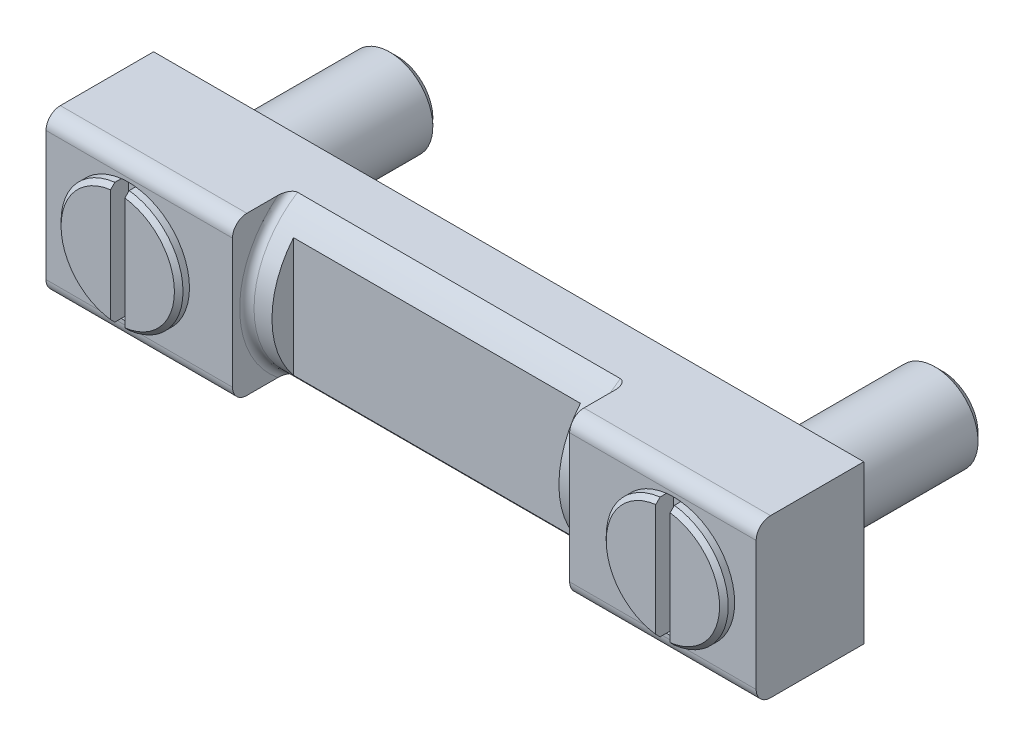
ISO-10303-21;
HEADER;
FILE_DESCRIPTION(('STEP AP214'),'2;1');
FILE_NAME('part.step','',(''),(''),'','','');
FILE_SCHEMA(('AUTOMOTIVE_DESIGN { 1 0 10303 214 1 1 1 1 }'));
ENDSEC;
DATA;
#1=APPLICATION_CONTEXT('core data for automotive mechanical design processes');
#2=APPLICATION_PROTOCOL_DEFINITION('international standard','automotive_design',2000,#1);
#3=PRODUCT_CONTEXT('',#1,'mechanical');
#4=PRODUCT('Part','Part','',(#3));
#5=PRODUCT_RELATED_PRODUCT_CATEGORY('part','',(#4));
#6=PRODUCT_DEFINITION_FORMATION('','',#4);
#7=PRODUCT_DEFINITION_CONTEXT('part definition',#1,'design');
#8=PRODUCT_DEFINITION('design','',#6,#7);
#9=PRODUCT_DEFINITION_SHAPE('','',#8);
#10=(LENGTH_UNIT() NAMED_UNIT(*) SI_UNIT(.MILLI.,.METRE.));
#11=(NAMED_UNIT(*) PLANE_ANGLE_UNIT() SI_UNIT($,.RADIAN.));
#12=(NAMED_UNIT(*) SI_UNIT($,.STERADIAN.) SOLID_ANGLE_UNIT());
#13=UNCERTAINTY_MEASURE_WITH_UNIT(LENGTH_MEASURE(1.E-05),#10,'distance_accuracy_value','');
#14=(GEOMETRIC_REPRESENTATION_CONTEXT(3) GLOBAL_UNCERTAINTY_ASSIGNED_CONTEXT((#13)) GLOBAL_UNIT_ASSIGNED_CONTEXT((#10,
#11,#12)) REPRESENTATION_CONTEXT('',''));
#15=CARTESIAN_POINT('',(0.,0.,0.));
#16=DIRECTION('',(0.,0.,1.));
#17=DIRECTION('',(1.,0.,0.));
#18=AXIS2_PLACEMENT_3D('',#15,#16,#17);
#19=CARTESIAN_POINT('',(0.,0.,16.5));
#20=DIRECTION('',(0.,0.,-1.));
#21=DIRECTION('',(0.,-1.,0.));
#22=AXIS2_PLACEMENT_3D('',#19,#20,#21);
#23=PLANE('',#22);
#24=DIRECTION('',(0.,1.,0.));
#25=VECTOR('',#24,1.);
#26=CARTESIAN_POINT('',(1.,0.,16.5));
#27=LINE('',#26,#25);
#28=CARTESIAN_POINT('',(1.,-7.83645327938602,16.5));
#29=VERTEX_POINT('',#28);
#30=CARTESIAN_POINT('',(1.,7.83645327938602,16.5));
#31=VERTEX_POINT('',#30);
#32=EDGE_CURVE('E476',#29,#31,#27,.T.);
#33=ORIENTED_EDGE('',*,*,#32,.F.);
#34=CARTESIAN_POINT('',(0.,0.,16.5));
#35=DIRECTION('',(0.,0.,-1.));
#36=DIRECTION('',(0.,-1.,0.));
#37=AXIS2_PLACEMENT_3D('',#34,#35,#36);
#38=CIRCLE('',#37,7.9);
#39=EDGE_CURVE('E463',#31,#29,#38,.T.);
#40=ORIENTED_EDGE('',*,*,#39,.F.);
#41=EDGE_LOOP('',(#33,#40));
#42=FACE_BOUND('',#41,.T.);
#43=ADVANCED_FACE('F14',(#42),#23,.F.);
#44=CARTESIAN_POINT('',(0.,0.,16.5));
#45=DIRECTION('',(0.,0.,-1.));
#46=DIRECTION('',(0.,-1.,0.));
#47=AXIS2_PLACEMENT_3D('',#44,#45,#46);
#48=CONICAL_SURFACE('',#47,7.9,0.785398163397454);
#49=CARTESIAN_POINT('',(1.,-18.679803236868,5.69344903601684));
#50=CARTESIAN_POINT('',(1.,-18.0426173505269,6.32971690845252));
#51=CARTESIAN_POINT('',(1.,-17.4053914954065,6.96594477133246));
#52=CARTESIAN_POINT('',(1.,-16.130803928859,8.23827567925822));
#53=CARTESIAN_POINT('',(1.,-15.4934422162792,8.87437872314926));
#54=CARTESIAN_POINT('',(1.,-14.218410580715,10.1465313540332));
#55=CARTESIAN_POINT('',(1.,-13.5807406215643,10.7825809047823));
#56=CARTESIAN_POINT('',(1.,-12.3051318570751,12.0543993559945));
#57=CARTESIAN_POINT('',(1.,-11.6671930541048,12.6901682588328));
#58=CARTESIAN_POINT('',(1.,-10.3730178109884,13.9790638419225));
#59=CARTESIAN_POINT('',(1.,-9.71676908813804,14.6321781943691));
#60=CARTESIAN_POINT('',(1.,-8.73176436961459,15.6112320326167));
#61=CARTESIAN_POINT('',(1.,-8.40331976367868,15.9374847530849));
#62=CARTESIAN_POINT('',(1.,-7.74613392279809,16.5896896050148));
#63=CARTESIAN_POINT('',(1.,-7.4173926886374,16.9156417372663));
#64=CARTESIAN_POINT('',(1.,-6.75951889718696,17.5670672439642));
#65=CARTESIAN_POINT('',(1.,-6.43038639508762,17.892540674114));
#66=CARTESIAN_POINT('',(1.,-5.77144282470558,18.5428066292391));
#67=CARTESIAN_POINT('',(1.,-5.4416317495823,18.8675991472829));
#68=CARTESIAN_POINT('',(1.,-4.78091756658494,19.5160428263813));
#69=CARTESIAN_POINT('',(1.,-4.45001451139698,19.8396940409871));
#70=CARTESIAN_POINT('',(1.,-3.95208457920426,20.3235451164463));
#71=CARTESIAN_POINT('',(1.,-3.78584672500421,20.4845565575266));
#72=CARTESIAN_POINT('',(1.,-3.45259821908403,20.8057773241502));
#73=CARTESIAN_POINT('',(1.,-3.28558757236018,20.9659866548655));
#74=CARTESIAN_POINT('',(1.,-3.07275870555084,21.1686442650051));
#75=CARTESIAN_POINT('',(1.,-3.02748694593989,21.2116664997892));
#76=CARTESIAN_POINT('',(1.,-2.93684423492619,21.2976064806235));
#77=CARTESIAN_POINT('',(1.,-2.89147328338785,21.3405242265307));
#78=CARTESIAN_POINT('',(1.,-2.75519136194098,21.4691007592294));
#79=CARTESIAN_POINT('',(1.,-2.66411247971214,21.554581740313));
#80=CARTESIAN_POINT('',(1.,-2.48162249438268,21.724676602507));
#81=CARTESIAN_POINT('',(1.,-2.39021303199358,21.8092922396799));
#82=CARTESIAN_POINT('',(1.,-2.20660269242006,21.9776533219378));
#83=CARTESIAN_POINT('',(1.,-2.1144018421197,22.061398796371));
#84=CARTESIAN_POINT('',(1.,-1.89748677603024,22.2558539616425));
#85=CARTESIAN_POINT('',(1.,-1.77234014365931,22.3660865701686));
#86=CARTESIAN_POINT('',(1.,-1.58183895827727,22.5288658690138));
#87=CARTESIAN_POINT('',(1.,-1.51770300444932,22.582835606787));
#88=CARTESIAN_POINT('',(1.,-1.38833234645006,22.6894113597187));
#89=CARTESIAN_POINT('',(1.,-1.32309795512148,22.7420177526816));
#90=CARTESIAN_POINT('',(1.,-1.19044796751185,22.8458314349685));
#91=CARTESIAN_POINT('',(1.,-1.12301697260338,22.8970191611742));
#92=CARTESIAN_POINT('',(1.,-0.985898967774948,22.9965179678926));
#93=CARTESIAN_POINT('',(1.,-0.916209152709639,23.0448252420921));
#94=CARTESIAN_POINT('',(1.,-0.774291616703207,23.1364359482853));
#95=CARTESIAN_POINT('',(1.,-0.702085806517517,23.1797729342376));
#96=CARTESIAN_POINT('',(1.,-0.553594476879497,23.2587163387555));
#97=CARTESIAN_POINT('',(1.,-0.477321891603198,23.2943456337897));
#98=CARTESIAN_POINT('',(1.,-0.368752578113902,23.3345348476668));
#99=CARTESIAN_POINT('',(1.,-0.338523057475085,23.3446584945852));
#100=CARTESIAN_POINT('',(1.,-0.277389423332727,23.3626522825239));
#101=CARTESIAN_POINT('',(1.,-0.246485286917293,23.3705223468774));
#102=CARTESIAN_POINT('',(1.,-0.184241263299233,23.3836220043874));
#103=CARTESIAN_POINT('',(1.,-0.152903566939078,23.3888618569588));
#104=CARTESIAN_POINT('',(1.,-0.0898818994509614,23.3964558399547));
#105=CARTESIAN_POINT('',(1.,-0.0581980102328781,23.3988106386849));
#106=CARTESIAN_POINT('',(1.,0.00544386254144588,23.4004937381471));
#107=CARTESIAN_POINT('',(1.,0.037402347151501,23.3998037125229));
#108=CARTESIAN_POINT('',(1.,0.101104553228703,23.3954059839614));
#109=CARTESIAN_POINT('',(1.,0.132848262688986,23.3916981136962));
#110=CARTESIAN_POINT('',(1.,0.227564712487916,23.3763230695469));
#111=CARTESIAN_POINT('',(1.,0.289862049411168,23.3604018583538));
#112=CARTESIAN_POINT('',(1.,0.412365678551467,23.3198995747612));
#113=CARTESIAN_POINT('',(1.,0.472529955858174,23.2951992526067));
#114=CARTESIAN_POINT('',(1.,0.590187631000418,23.2399897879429));
#115=CARTESIAN_POINT('',(1.,0.647676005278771,23.2094702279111));
#116=CARTESIAN_POINT('',(1.,0.760829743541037,23.1443310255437));
#117=CARTESIAN_POINT('',(1.,0.816477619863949,23.109681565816));
#118=CARTESIAN_POINT('',(1.,0.898598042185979,23.0557315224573));
#119=CARTESIAN_POINT('',(1.,0.925735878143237,23.0374264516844));
#120=CARTESIAN_POINT('',(1.,0.979624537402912,23.000255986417));
#121=CARTESIAN_POINT('',(1.,1.00637537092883,22.9813906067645));
#122=CARTESIAN_POINT('',(1.,1.09079014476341,22.9207440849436));
#123=CARTESIAN_POINT('',(1.,1.14782888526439,22.8780931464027));
#124=CARTESIAN_POINT('',(1.,1.26071517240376,22.7912384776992));
#125=CARTESIAN_POINT('',(1.,1.31656252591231,22.7470344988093));
#126=CARTESIAN_POINT('',(1.,1.48280528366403,22.6127117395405));
#127=CARTESIAN_POINT('',(1.,1.59184738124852,22.5209222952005));
#128=CARTESIAN_POINT('',(1.,1.80792759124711,22.3346550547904));
#129=CARTESIAN_POINT('',(1.,1.91496169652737,22.2401726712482));
#130=CARTESIAN_POINT('',(1.,2.12755306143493,22.0496249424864));
#131=CARTESIAN_POINT('',(1.,2.23311074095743,21.9535600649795));
#132=CARTESIAN_POINT('',(1.,2.44293123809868,21.7606392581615));
#133=CARTESIAN_POINT('',(1.,2.54719692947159,21.663786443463));
#134=CARTESIAN_POINT('',(1.,2.755033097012,21.4693234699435));
#135=CARTESIAN_POINT('',(1.,2.85860352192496,21.3717132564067));
#136=CARTESIAN_POINT('',(1.,3.06511328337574,21.1760534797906));
#137=CARTESIAN_POINT('',(1.,3.16805318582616,21.07800451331));
#138=CARTESIAN_POINT('',(1.,3.37353720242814,20.8814980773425));
#139=CARTESIAN_POINT('',(1.,3.47608132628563,20.7830406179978));
#140=CARTESIAN_POINT('',(1.,3.78230203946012,20.4881243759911));
#141=CARTESIAN_POINT('',(1.,3.9855327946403,20.2912028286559));
#142=CARTESIAN_POINT('',(1.,4.39123697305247,19.89658074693));
#143=CARTESIAN_POINT('',(1.,4.59371039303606,19.6988802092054));
#144=CARTESIAN_POINT('',(1.,5.20038255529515,19.1049988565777));
#145=CARTESIAN_POINT('',(1.,5.60382522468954,18.7080460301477));
#146=CARTESIAN_POINT('',(1.,6.40985972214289,17.9129299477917));
#147=CARTESIAN_POINT('',(1.,6.8124511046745,17.5147662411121));
#148=CARTESIAN_POINT('',(1.,7.61701514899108,16.7178216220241));
#149=CARTESIAN_POINT('',(1.,8.01898781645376,16.3190407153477));
#150=CARTESIAN_POINT('',(1.,8.82250964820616,15.5211232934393));
#151=CARTESIAN_POINT('',(1.,9.22405884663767,15.1219868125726));
#152=CARTESIAN_POINT('',(1.,10.0268944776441,14.3234477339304));
#153=CARTESIAN_POINT('',(1.,10.4281809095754,13.9240451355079));
#154=CARTESIAN_POINT('',(1.,11.6316695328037,12.7256598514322));
#155=CARTESIAN_POINT('',(1.,12.433598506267,11.9264028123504));
#156=CARTESIAN_POINT('',(1.,13.6892254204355,10.6743385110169));
#157=CARTESIAN_POINT('',(1.,14.1430581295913,10.2216663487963));
#158=CARTESIAN_POINT('',(1.,15.050639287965,9.31620849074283));
#159=CARTESIAN_POINT('',(1.,15.5043877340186,8.86342279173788));
#160=CARTESIAN_POINT('',(1.,16.4117880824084,7.95779863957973));
#161=CARTESIAN_POINT('',(1.,16.8654399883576,7.50496019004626));
#162=CARTESIAN_POINT('',(1.,17.7726697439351,6.59923825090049));
#163=CARTESIAN_POINT('',(1.,18.2262475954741,6.14635476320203));
#164=CARTESIAN_POINT('',(1.,18.679803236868,5.69344903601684));
#165=B_SPLINE_CURVE_WITH_KNOTS('',3,(#49,#50,#51,#52,#53,#54,#55,#56,#57,#58,#59,#60,#61,#62,
#63,#64,#65,#66,#67,#68,#69,#70,#71,#72,#73,#74,#75,#76,#77,#78,#79,#80,#81,#82,#83,#84,#85,#86,
#87,#88,#89,#90,#91,#92,#93,#94,#95,#96,#97,#98,#99,#100,#101,#102,#103,#104,#105,#106,#107,
#108,#109,#110,#111,#112,#113,#114,#115,#116,#117,#118,#119,#120,#121,#122,#123,#124,#125,#126,
#127,#128,#129,#130,#131,#132,#133,#134,#135,#136,#137,#138,#139,#140,#141,#142,#143,#144,#145,
#146,#147,#148,#149,#150,#151,#152,#153,#154,#155,#156,#157,#158,#159,#160,#161,#162,#163,#164),
.UNSPECIFIED.,.F.,.F.,(4,2,2,2,2,2,2,2,2,2,2,2,2,2,2,2,2,2,2,2,2,2,2,2,2,2,2,2,2,2,2,2,2,2,2,2,
2,2,2,2,2,2,2,2,2,2,2,2,2,2,2,2,2,2,2,2,2,4),(0.,2.70140408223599,5.40283207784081,
8.10480130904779,10.8067472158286,13.5843332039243,14.9731636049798,16.3619903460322,
17.7506401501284,19.1393040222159,20.5279018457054,21.222189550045,21.9164727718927,
22.1038332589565,22.2911940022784,22.6659202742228,23.0395988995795,23.4132648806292,
23.9135263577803,24.1649805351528,24.4163642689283,24.6702936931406,24.9245515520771,
25.1769769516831,25.4286425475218,25.5242105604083,25.619781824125,25.714977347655,
25.8101508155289,25.9058978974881,26.0016502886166,26.1936298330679,26.3883235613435,
26.5833691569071,26.7799196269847,26.8781176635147,26.9763131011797,27.1899349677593,
27.4035912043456,27.8311053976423,28.2593974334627,28.6875650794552,29.114487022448,
29.5414400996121,29.9679266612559,30.3944026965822,31.2433555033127,32.0923119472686,
33.7902581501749,35.4889416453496,37.1876094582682,38.8861278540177,40.5846503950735,
43.9812832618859,45.9042720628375,47.8273224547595,49.7502796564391,51.6731750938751),.UNSPECIFIED.);
#166=CARTESIAN_POINT('',(1.,-8.44097150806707,15.9));
#167=VERTEX_POINT('',#166);
#168=EDGE_CURVE('E478',#167,#29,#165,.T.);
#169=ORIENTED_EDGE('',*,*,#168,.F.);
#170=CARTESIAN_POINT('',(0.,0.,15.9));
#171=DIRECTION('',(0.,0.,-1.));
#172=DIRECTION('',(0.,-1.,0.));
#173=AXIS2_PLACEMENT_3D('',#170,#171,#172);
#174=CIRCLE('',#173,8.5);
#175=CARTESIAN_POINT('',(1.,8.44097150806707,15.9));
#176=VERTEX_POINT('',#175);
#177=EDGE_CURVE('E507',#176,#167,#174,.T.);
#178=ORIENTED_EDGE('',*,*,#177,.F.);
#179=EDGE_CURVE('E473',#31,#176,#165,.T.);
#180=ORIENTED_EDGE('',*,*,#179,.F.);
#181=ORIENTED_EDGE('',*,*,#39,.T.);
#182=EDGE_LOOP('',(#169,#178,#180,#181));
#183=FACE_BOUND('',#182,.T.);
#184=ADVANCED_FACE('F421',(#183),#48,.T.);
#185=CARTESIAN_POINT('',(-1.,12.,14.));
#186=DIRECTION('',(0.,0.,1.));
#187=DIRECTION('',(0.,1.,0.));
#188=AXIS2_PLACEMENT_3D('',#185,#186,#187);
#189=PLANE('',#188);
#190=CARTESIAN_POINT('',(0.,0.,14.));
#191=DIRECTION('',(0.,0.,1.));
#192=DIRECTION('',(0.,1.,0.));
#193=AXIS2_PLACEMENT_3D('',#190,#191,#192);
#194=CIRCLE('',#193,8.5);
#195=CARTESIAN_POINT('',(-1.,-8.44097150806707,14.));
#196=VERTEX_POINT('',#195);
#197=CARTESIAN_POINT('',(1.,-8.44097150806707,14.));
#198=VERTEX_POINT('',#197);
#199=EDGE_CURVE('E512',#196,#198,#194,.T.);
#200=ORIENTED_EDGE('',*,*,#199,.T.);
#201=DIRECTION('',(0.,-1.,0.));
#202=VECTOR('',#201,1.);
#203=CARTESIAN_POINT('',(1.,12.,14.));
#204=LINE('',#203,#202);
#205=CARTESIAN_POINT('',(1.,8.44097150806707,14.));
#206=VERTEX_POINT('',#205);
#207=EDGE_CURVE('E1027',#206,#198,#204,.T.);
#208=ORIENTED_EDGE('',*,*,#207,.F.);
#209=CARTESIAN_POINT('',(-1.,8.44097150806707,14.));
#210=VERTEX_POINT('',#209);
#211=EDGE_CURVE('E516',#206,#210,#194,.T.);
#212=ORIENTED_EDGE('',*,*,#211,.T.);
#213=DIRECTION('',(0.,-1.,0.));
#214=VECTOR('',#213,1.);
#215=CARTESIAN_POINT('',(-1.,12.,14.));
#216=LINE('',#215,#214);
#217=EDGE_CURVE('E1026',#210,#196,#216,.T.);
#218=ORIENTED_EDGE('',*,*,#217,.T.);
#219=EDGE_LOOP('',(#200,#208,#212,#218));
#220=FACE_BOUND('',#219,.T.);
#221=ADVANCED_FACE('F429',(#220),#189,.T.);
#222=CARTESIAN_POINT('',(0.,0.,-22.5));
#223=DIRECTION('',(0.,0.,-1.));
#224=DIRECTION('',(0.,-1.,0.));
#225=AXIS2_PLACEMENT_3D('',#222,#223,#224);
#226=CYLINDRICAL_SURFACE('',#225,8.5);
#227=CARTESIAN_POINT('',(0.,0.,15.));
#228=DIRECTION('',(0.,0.,-1.));
#229=DIRECTION('',(0.,-1.,0.));
#230=AXIS2_PLACEMENT_3D('',#227,#228,#229);
#231=CIRCLE('',#230,8.5);
#232=CARTESIAN_POINT('',(1.,8.44097150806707,15.));
#233=VERTEX_POINT('',#232);
#234=CARTESIAN_POINT('',(1.,-8.44097150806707,15.));
#235=VERTEX_POINT('',#234);
#236=EDGE_CURVE('E24',#233,#235,#231,.T.);
#237=ORIENTED_EDGE('',*,*,#236,.F.);
#238=DIRECTION('',(0.,0.,-1.));
#239=VECTOR('',#238,1.);
#240=CARTESIAN_POINT('',(1.,8.44097150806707,-22.5));
#241=LINE('',#240,#239);
#242=EDGE_CURVE('E521',#176,#233,#241,.T.);
#243=ORIENTED_EDGE('',*,*,#242,.F.);
#244=ORIENTED_EDGE('',*,*,#177,.T.);
#245=DIRECTION('',(0.,0.,-1.));
#246=VECTOR('',#245,1.);
#247=CARTESIAN_POINT('',(1.,-8.44097150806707,-22.5));
#248=LINE('',#247,#246);
#249=EDGE_CURVE('E462',#235,#167,#248,.F.);
#250=ORIENTED_EDGE('',*,*,#249,.F.);
#251=EDGE_LOOP('',(#237,#243,#244,#250));
#252=FACE_BOUND('',#251,.T.);
#253=ADVANCED_FACE('F448',(#252),#226,.T.);
#254=CARTESIAN_POINT('',(1.,0.,0.));
#255=DIRECTION('',(-1.,0.,0.));
#256=DIRECTION('',(0.,0.,1.));
#257=AXIS2_PLACEMENT_3D('',#254,#255,#256);
#258=PLANE('',#257);
#259=ORIENTED_EDGE('',*,*,#242,.T.);
#260=EDGE_CURVE('E520',#233,#206,#241,.T.);
#261=ORIENTED_EDGE('',*,*,#260,.T.);
#262=ORIENTED_EDGE('',*,*,#207,.T.);
#263=EDGE_CURVE('E509',#198,#235,#248,.F.);
#264=ORIENTED_EDGE('',*,*,#263,.T.);
#265=ORIENTED_EDGE('',*,*,#249,.T.);
#266=ORIENTED_EDGE('',*,*,#168,.T.);
#267=ORIENTED_EDGE('',*,*,#32,.T.);
#268=ORIENTED_EDGE('',*,*,#179,.T.);
#269=EDGE_LOOP('',(#259,#261,#262,#264,#265,#266,#267,#268));
#270=FACE_BOUND('',#269,.T.);
#271=ADVANCED_FACE('F445',(#270),#258,.T.);
#272=CARTESIAN_POINT('',(-1.,-8.44097150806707,15.));
#273=VERTEX_POINT('',#272);
#274=CARTESIAN_POINT('',(-1.,8.44097150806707,15.));
#275=VERTEX_POINT('',#274);
#276=EDGE_CURVE('E9',#273,#275,#231,.T.);
#277=ORIENTED_EDGE('',*,*,#276,.F.);
#278=DIRECTION('',(0.,0.,-1.));
#279=VECTOR('',#278,1.);
#280=CARTESIAN_POINT('',(-1.,-8.44097150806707,-22.5));
#281=LINE('',#280,#279);
#282=CARTESIAN_POINT('',(-1.,-8.44097150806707,15.9));
#283=VERTEX_POINT('',#282);
#284=EDGE_CURVE('E515',#273,#283,#281,.F.);
#285=ORIENTED_EDGE('',*,*,#284,.T.);
#286=CARTESIAN_POINT('',(-1.,8.44097150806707,15.9));
#287=VERTEX_POINT('',#286);
#288=EDGE_CURVE('E472',#283,#287,#174,.T.);
#289=ORIENTED_EDGE('',*,*,#288,.T.);
#290=DIRECTION('',(0.,0.,-1.));
#291=VECTOR('',#290,1.);
#292=CARTESIAN_POINT('',(-1.,8.44097150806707,-22.5));
#293=LINE('',#292,#291);
#294=EDGE_CURVE('E524',#287,#275,#293,.T.);
#295=ORIENTED_EDGE('',*,*,#294,.T.);
#296=EDGE_LOOP('',(#277,#285,#289,#295));
#297=FACE_BOUND('',#296,.T.);
#298=ADVANCED_FACE('F436',(#297),#226,.T.);
#299=CARTESIAN_POINT('',(-1.,-7.83645327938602,16.5));
#300=VERTEX_POINT('',#299);
#301=CARTESIAN_POINT('',(-1.,7.83645327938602,16.5));
#302=VERTEX_POINT('',#301);
#303=EDGE_CURVE('E453',#300,#302,#38,.T.);
#304=ORIENTED_EDGE('',*,*,#303,.F.);
#305=DIRECTION('',(0.,1.,0.));
#306=VECTOR('',#305,1.);
#307=CARTESIAN_POINT('',(-1.,0.,16.5));
#308=LINE('',#307,#306);
#309=EDGE_CURVE('E456',#300,#302,#308,.T.);
#310=ORIENTED_EDGE('',*,*,#309,.T.);
#311=EDGE_LOOP('',(#304,#310));
#312=FACE_BOUND('',#311,.T.);
#313=ADVANCED_FACE('F424',(#312),#23,.F.);
#314=ORIENTED_EDGE('',*,*,#303,.T.);
#315=CARTESIAN_POINT('',(-1.,-18.679803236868,5.69344903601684));
#316=CARTESIAN_POINT('',(-1.,-18.0426173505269,6.32971690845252));
#317=CARTESIAN_POINT('',(-1.,-17.4053914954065,6.96594477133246));
#318=CARTESIAN_POINT('',(-1.,-16.130803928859,8.23827567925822));
#319=CARTESIAN_POINT('',(-1.,-15.4934422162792,8.87437872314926));
#320=CARTESIAN_POINT('',(-1.,-14.218410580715,10.1465313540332));
#321=CARTESIAN_POINT('',(-1.,-13.5807406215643,10.7825809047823));
#322=CARTESIAN_POINT('',(-1.,-12.3051318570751,12.0543993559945));
#323=CARTESIAN_POINT('',(-1.,-11.6671930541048,12.6901682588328));
#324=CARTESIAN_POINT('',(-1.,-10.3730178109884,13.9790638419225));
#325=CARTESIAN_POINT('',(-1.,-9.71676908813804,14.6321781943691));
#326=CARTESIAN_POINT('',(-1.,-8.73176436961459,15.6112320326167));
#327=CARTESIAN_POINT('',(-1.,-8.40331976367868,15.9374847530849));
#328=CARTESIAN_POINT('',(-1.,-7.74613392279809,16.5896896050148));
#329=CARTESIAN_POINT('',(-1.,-7.4173926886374,16.9156417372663));
#330=CARTESIAN_POINT('',(-1.,-6.75951889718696,17.5670672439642));
#331=CARTESIAN_POINT('',(-1.,-6.43038639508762,17.892540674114));
#332=CARTESIAN_POINT('',(-1.,-5.77144282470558,18.5428066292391));
#333=CARTESIAN_POINT('',(-1.,-5.4416317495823,18.8675991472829));
#334=CARTESIAN_POINT('',(-1.,-4.78091756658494,19.5160428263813));
#335=CARTESIAN_POINT('',(-1.,-4.45001451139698,19.8396940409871));
#336=CARTESIAN_POINT('',(-1.,-3.95208457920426,20.3235451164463));
#337=CARTESIAN_POINT('',(-1.,-3.78584672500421,20.4845565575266));
#338=CARTESIAN_POINT('',(-1.,-3.45259821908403,20.8057773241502));
#339=CARTESIAN_POINT('',(-1.,-3.28558757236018,20.9659866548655));
#340=CARTESIAN_POINT('',(-1.,-3.07275870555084,21.1686442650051));
#341=CARTESIAN_POINT('',(-1.,-3.02748694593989,21.2116664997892));
#342=CARTESIAN_POINT('',(-1.,-2.93684423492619,21.2976064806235));
#343=CARTESIAN_POINT('',(-1.,-2.89147328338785,21.3405242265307));
#344=CARTESIAN_POINT('',(-1.,-2.75519136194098,21.4691007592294));
#345=CARTESIAN_POINT('',(-1.,-2.66411247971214,21.554581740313));
#346=CARTESIAN_POINT('',(-1.,-2.48162249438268,21.724676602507));
#347=CARTESIAN_POINT('',(-1.,-2.39021303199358,21.8092922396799));
#348=CARTESIAN_POINT('',(-1.,-2.20660269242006,21.9776533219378));
#349=CARTESIAN_POINT('',(-1.,-2.1144018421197,22.061398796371));
#350=CARTESIAN_POINT('',(-1.,-1.89748677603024,22.2558539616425));
#351=CARTESIAN_POINT('',(-1.,-1.77234014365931,22.3660865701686));
#352=CARTESIAN_POINT('',(-1.,-1.58183895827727,22.5288658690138));
#353=CARTESIAN_POINT('',(-1.,-1.51770300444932,22.582835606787));
#354=CARTESIAN_POINT('',(-1.,-1.38833234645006,22.6894113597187));
#355=CARTESIAN_POINT('',(-1.,-1.32309795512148,22.7420177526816));
#356=CARTESIAN_POINT('',(-1.,-1.19044796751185,22.8458314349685));
#357=CARTESIAN_POINT('',(-1.,-1.12301697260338,22.8970191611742));
#358=CARTESIAN_POINT('',(-1.,-0.985898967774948,22.9965179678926));
#359=CARTESIAN_POINT('',(-1.,-0.916209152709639,23.0448252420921));
#360=CARTESIAN_POINT('',(-1.,-0.774291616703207,23.1364359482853));
#361=CARTESIAN_POINT('',(-1.,-0.702085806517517,23.1797729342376));
#362=CARTESIAN_POINT('',(-1.,-0.553594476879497,23.2587163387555));
#363=CARTESIAN_POINT('',(-1.,-0.477321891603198,23.2943456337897));
#364=CARTESIAN_POINT('',(-1.,-0.368752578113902,23.3345348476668));
#365=CARTESIAN_POINT('',(-1.,-0.338523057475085,23.3446584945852));
#366=CARTESIAN_POINT('',(-1.,-0.277389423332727,23.3626522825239));
#367=CARTESIAN_POINT('',(-1.,-0.246485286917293,23.3705223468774));
#368=CARTESIAN_POINT('',(-1.,-0.184241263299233,23.3836220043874));
#369=CARTESIAN_POINT('',(-1.,-0.152903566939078,23.3888618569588));
#370=CARTESIAN_POINT('',(-1.,-0.0898818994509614,23.3964558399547));
#371=CARTESIAN_POINT('',(-1.,-0.0581980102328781,23.3988106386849));
#372=CARTESIAN_POINT('',(-1.,0.00544386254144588,23.4004937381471));
#373=CARTESIAN_POINT('',(-1.,0.037402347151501,23.3998037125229));
#374=CARTESIAN_POINT('',(-1.,0.101104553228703,23.3954059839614));
#375=CARTESIAN_POINT('',(-1.,0.132848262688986,23.3916981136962));
#376=CARTESIAN_POINT('',(-1.,0.227564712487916,23.3763230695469));
#377=CARTESIAN_POINT('',(-1.,0.289862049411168,23.3604018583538));
#378=CARTESIAN_POINT('',(-1.,0.412365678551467,23.3198995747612));
#379=CARTESIAN_POINT('',(-1.,0.472529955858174,23.2951992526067));
#380=CARTESIAN_POINT('',(-1.,0.590187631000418,23.2399897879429));
#381=CARTESIAN_POINT('',(-1.,0.647676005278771,23.2094702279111));
#382=CARTESIAN_POINT('',(-1.,0.760829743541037,23.1443310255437));
#383=CARTESIAN_POINT('',(-1.,0.816477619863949,23.109681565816));
#384=CARTESIAN_POINT('',(-1.,0.898598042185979,23.0557315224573));
#385=CARTESIAN_POINT('',(-1.,0.925735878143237,23.0374264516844));
#386=CARTESIAN_POINT('',(-1.,0.979624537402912,23.000255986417));
#387=CARTESIAN_POINT('',(-1.,1.00637537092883,22.9813906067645));
#388=CARTESIAN_POINT('',(-1.,1.09079014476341,22.9207440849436));
#389=CARTESIAN_POINT('',(-1.,1.14782888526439,22.8780931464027));
#390=CARTESIAN_POINT('',(-1.,1.26071517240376,22.7912384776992));
#391=CARTESIAN_POINT('',(-1.,1.31656252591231,22.7470344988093));
#392=CARTESIAN_POINT('',(-1.,1.48280528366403,22.6127117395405));
#393=CARTESIAN_POINT('',(-1.,1.59184738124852,22.5209222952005));
#394=CARTESIAN_POINT('',(-1.,1.80792759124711,22.3346550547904));
#395=CARTESIAN_POINT('',(-1.,1.91496169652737,22.2401726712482));
#396=CARTESIAN_POINT('',(-1.,2.12755306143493,22.0496249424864));
#397=CARTESIAN_POINT('',(-1.,2.23311074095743,21.9535600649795));
#398=CARTESIAN_POINT('',(-1.,2.44293123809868,21.7606392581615));
#399=CARTESIAN_POINT('',(-1.,2.54719692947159,21.663786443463));
#400=CARTESIAN_POINT('',(-1.,2.755033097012,21.4693234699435));
#401=CARTESIAN_POINT('',(-1.,2.85860352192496,21.3717132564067));
#402=CARTESIAN_POINT('',(-1.,3.06511328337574,21.1760534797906));
#403=CARTESIAN_POINT('',(-1.,3.16805318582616,21.07800451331));
#404=CARTESIAN_POINT('',(-1.,3.37353720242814,20.8814980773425));
#405=CARTESIAN_POINT('',(-1.,3.47608132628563,20.7830406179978));
#406=CARTESIAN_POINT('',(-1.,3.78230203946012,20.4881243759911));
#407=CARTESIAN_POINT('',(-1.,3.9855327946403,20.2912028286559));
#408=CARTESIAN_POINT('',(-1.,4.39123697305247,19.89658074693));
#409=CARTESIAN_POINT('',(-1.,4.59371039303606,19.6988802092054));
#410=CARTESIAN_POINT('',(-1.,5.20038255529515,19.1049988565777));
#411=CARTESIAN_POINT('',(-1.,5.60382522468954,18.7080460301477));
#412=CARTESIAN_POINT('',(-1.,6.40985972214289,17.9129299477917));
#413=CARTESIAN_POINT('',(-1.,6.8124511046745,17.5147662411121));
#414=CARTESIAN_POINT('',(-1.,7.61701514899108,16.7178216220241));
#415=CARTESIAN_POINT('',(-1.,8.01898781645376,16.3190407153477));
#416=CARTESIAN_POINT('',(-1.,8.82250964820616,15.5211232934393));
#417=CARTESIAN_POINT('',(-1.,9.22405884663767,15.1219868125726));
#418=CARTESIAN_POINT('',(-1.,10.0268944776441,14.3234477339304));
#419=CARTESIAN_POINT('',(-1.,10.4281809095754,13.9240451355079));
#420=CARTESIAN_POINT('',(-1.,11.6316695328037,12.7256598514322));
#421=CARTESIAN_POINT('',(-1.,12.433598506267,11.9264028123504));
#422=CARTESIAN_POINT('',(-1.,13.6892254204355,10.6743385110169));
#423=CARTESIAN_POINT('',(-1.,14.1430581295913,10.2216663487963));
#424=CARTESIAN_POINT('',(-1.,15.050639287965,9.31620849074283));
#425=CARTESIAN_POINT('',(-1.,15.5043877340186,8.86342279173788));
#426=CARTESIAN_POINT('',(-1.,16.4117880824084,7.95779863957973));
#427=CARTESIAN_POINT('',(-1.,16.8654399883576,7.50496019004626));
#428=CARTESIAN_POINT('',(-1.,17.7726697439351,6.59923825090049));
#429=CARTESIAN_POINT('',(-1.,18.2262475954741,6.14635476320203));
#430=CARTESIAN_POINT('',(-1.,18.679803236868,5.69344903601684));
#431=B_SPLINE_CURVE_WITH_KNOTS('',3,(#315,#316,#317,#318,#319,#320,#321,#322,#323,#324,#325,
#326,#327,#328,#329,#330,#331,#332,#333,#334,#335,#336,#337,#338,#339,#340,#341,#342,#343,#344,
#345,#346,#347,#348,#349,#350,#351,#352,#353,#354,#355,#356,#357,#358,#359,#360,#361,#362,#363,
#364,#365,#366,#367,#368,#369,#370,#371,#372,#373,#374,#375,#376,#377,#378,#379,#380,#381,#382,
#383,#384,#385,#386,#387,#388,#389,#390,#391,#392,#393,#394,#395,#396,#397,#398,#399,#400,#401,
#402,#403,#404,#405,#406,#407,#408,#409,#410,#411,#412,#413,#414,#415,#416,#417,#418,#419,#420,
#421,#422,#423,#424,#425,#426,#427,#428,#429,#430),.UNSPECIFIED.,.F.,.F.,(4,2,2,2,2,2,2,2,2,2,2,
2,2,2,2,2,2,2,2,2,2,2,2,2,2,2,2,2,2,2,2,2,2,2,2,2,2,2,2,2,2,2,2,2,2,2,2,2,2,2,2,2,2,2,2,2,2,4),
(0.,2.70140408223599,5.40283207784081,8.10480130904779,10.8067472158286,13.5843332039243,
14.9731636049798,16.3619903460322,17.7506401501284,19.1393040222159,20.5279018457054,
21.222189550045,21.9164727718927,22.1038332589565,22.2911940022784,22.6659202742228,
23.0395988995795,23.4132648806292,23.9135263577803,24.1649805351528,24.4163642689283,
24.6702936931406,24.9245515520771,25.1769769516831,25.4286425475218,25.5242105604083,
25.619781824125,25.714977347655,25.8101508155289,25.9058978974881,26.0016502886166,
26.1936298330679,26.3883235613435,26.5833691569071,26.7799196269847,26.8781176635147,
26.9763131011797,27.1899349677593,27.4035912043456,27.8311053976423,28.2593974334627,
28.6875650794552,29.114487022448,29.5414400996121,29.9679266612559,30.3944026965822,
31.2433555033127,32.0923119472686,33.7902581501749,35.4889416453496,37.1876094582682,
38.8861278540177,40.5846503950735,43.9812832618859,45.9042720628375,47.8273224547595,
49.7502796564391,51.6731750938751),.UNSPECIFIED.);
#432=EDGE_CURVE('E468',#302,#287,#431,.T.);
#433=ORIENTED_EDGE('',*,*,#432,.T.);
#434=ORIENTED_EDGE('',*,*,#288,.F.);
#435=EDGE_CURVE('E467',#283,#300,#431,.T.);
#436=ORIENTED_EDGE('',*,*,#435,.T.);
#437=EDGE_LOOP('',(#314,#433,#434,#436));
#438=FACE_BOUND('',#437,.T.);
#439=ADVANCED_FACE('F432',(#438),#48,.T.);
#440=CARTESIAN_POINT('',(-1.,0.,0.));
#441=DIRECTION('',(-1.,0.,0.));
#442=DIRECTION('',(0.,0.,1.));
#443=AXIS2_PLACEMENT_3D('',#440,#441,#442);
#444=PLANE('',#443);
#445=ORIENTED_EDGE('',*,*,#432,.F.);
#446=ORIENTED_EDGE('',*,*,#309,.F.);
#447=ORIENTED_EDGE('',*,*,#435,.F.);
#448=ORIENTED_EDGE('',*,*,#284,.F.);
#449=EDGE_CURVE('E517',#196,#273,#281,.F.);
#450=ORIENTED_EDGE('',*,*,#449,.F.);
#451=ORIENTED_EDGE('',*,*,#217,.F.);
#452=EDGE_CURVE('E33',#275,#210,#293,.T.);
#453=ORIENTED_EDGE('',*,*,#452,.F.);
#454=ORIENTED_EDGE('',*,*,#294,.F.);
#455=EDGE_LOOP('',(#445,#446,#447,#448,#450,#451,#453,#454));
#456=FACE_BOUND('',#455,.T.);
#457=ADVANCED_FACE('F443',(#456),#444,.F.);
#458=CARTESIAN_POINT('',(0.,0.,0.));
#459=DIRECTION('',(0.,0.,-1.));
#460=DIRECTION('',(0.,-1.,0.));
#461=AXIS2_PLACEMENT_3D('',#458,#459,#460);
#462=CONICAL_SURFACE('',#461,4.9265,0.785398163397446);
#463=CARTESIAN_POINT('',(0.,0.,-1.0735));
#464=DIRECTION('',(0.,0.,-1.));
#465=DIRECTION('',(0.,-1.,0.));
#466=AXIS2_PLACEMENT_3D('',#463,#464,#465);
#467=CIRCLE('',#466,6.);
#468=CARTESIAN_POINT('',(0.,-6.,-1.0735));
#469=VERTEX_POINT('',#468);
#470=EDGE_CURVE('E493',#469,#469,#467,.T.);
#471=ORIENTED_EDGE('',*,*,#470,.F.);
#472=EDGE_LOOP('',(#471));
#473=FACE_BOUND('',#472,.T.);
#474=CARTESIAN_POINT('',(0.,0.,0.));
#475=DIRECTION('',(0.,0.,-1.));
#476=DIRECTION('',(0.,-1.,0.));
#477=AXIS2_PLACEMENT_3D('',#474,#475,#476);
#478=CIRCLE('',#477,4.9265);
#479=CARTESIAN_POINT('',(0.,-4.9265,0.));
#480=VERTEX_POINT('',#479);
#481=EDGE_CURVE('E498',#480,#480,#478,.T.);
#482=ORIENTED_EDGE('',*,*,#481,.T.);
#483=EDGE_LOOP('',(#482));
#484=FACE_BOUND('',#483,.T.);
#485=ADVANCED_FACE('F717',(#473,#484),#462,.T.);
#486=CARTESIAN_POINT('',(0.,0.,-22.5));
#487=DIRECTION('',(0.,0.,-1.));
#488=DIRECTION('',(0.,-1.,0.));
#489=AXIS2_PLACEMENT_3D('',#486,#487,#488);
#490=CYLINDRICAL_SURFACE('',#489,4.9265);
#491=ORIENTED_EDGE('',*,*,#481,.F.);
#492=EDGE_LOOP('',(#491));
#493=FACE_BOUND('',#492,.T.);
#494=CARTESIAN_POINT('',(0.,0.,3.));
#495=DIRECTION('',(0.,0.,-1.));
#496=DIRECTION('',(0.,-1.,0.));
#497=AXIS2_PLACEMENT_3D('',#494,#495,#496);
#498=CIRCLE('',#497,4.9265);
#499=CARTESIAN_POINT('',(0.,-4.9265,3.));
#500=VERTEX_POINT('',#499);
#501=EDGE_CURVE('E501',#500,#500,#498,.T.);
#502=ORIENTED_EDGE('',*,*,#501,.T.);
#503=EDGE_LOOP('',(#502));
#504=FACE_BOUND('',#503,.T.);
#505=ADVANCED_FACE('F906',(#493,#504),#490,.T.);
#506=CARTESIAN_POINT('',(-6.,0.,3.));
#507=DIRECTION('',(0.,0.,1.));
#508=DIRECTION('',(0.,1.,0.));
#509=AXIS2_PLACEMENT_3D('',#506,#507,#508);
#510=PLANE('',#509);
#511=ORIENTED_EDGE('',*,*,#501,.F.);
#512=EDGE_LOOP('',(#511));
#513=FACE_BOUND('',#512,.T.);
#514=CARTESIAN_POINT('',(0.,0.,3.));
#515=DIRECTION('',(0.,0.,-1.));
#516=DIRECTION('',(0.,-1.,0.));
#517=AXIS2_PLACEMENT_3D('',#514,#515,#516);
#518=CIRCLE('',#517,6.);
#519=CARTESIAN_POINT('',(0.,-6.,3.));
#520=VERTEX_POINT('',#519);
#521=EDGE_CURVE('E504',#520,#520,#518,.T.);
#522=ORIENTED_EDGE('',*,*,#521,.T.);
#523=EDGE_LOOP('',(#522));
#524=FACE_BOUND('',#523,.T.);
#525=ADVANCED_FACE('F607',(#513,#524),#510,.F.);
#526=CARTESIAN_POINT('',(76.,0.,16.5));
#527=DIRECTION('',(0.,0.,-1.));
#528=DIRECTION('',(0.,-1.,0.));
#529=AXIS2_PLACEMENT_3D('',#526,#527,#528);
#530=PLANE('',#529);
#531=DIRECTION('',(0.,1.,0.));
#532=VECTOR('',#531,1.);
#533=CARTESIAN_POINT('',(77.,0.,16.5));
#534=LINE('',#533,#532);
#535=CARTESIAN_POINT('',(77.,-7.83645327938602,16.5));
#536=VERTEX_POINT('',#535);
#537=CARTESIAN_POINT('',(77.,7.83645327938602,16.5));
#538=VERTEX_POINT('',#537);
#539=EDGE_CURVE('E541',#536,#538,#534,.T.);
#540=ORIENTED_EDGE('',*,*,#539,.F.);
#541=CARTESIAN_POINT('',(76.,0.,16.5));
#542=DIRECTION('',(0.,0.,-1.));
#543=DIRECTION('',(0.,-1.,0.));
#544=AXIS2_PLACEMENT_3D('',#541,#542,#543);
#545=CIRCLE('',#544,7.9);
#546=EDGE_CURVE('E630',#538,#536,#545,.T.);
#547=ORIENTED_EDGE('',*,*,#546,.F.);
#548=EDGE_LOOP('',(#540,#547));
#549=FACE_BOUND('',#548,.T.);
#550=ADVANCED_FACE('F601',(#549),#530,.F.);
#551=CARTESIAN_POINT('',(75.,-7.83645327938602,16.5));
#552=VERTEX_POINT('',#551);
#553=CARTESIAN_POINT('',(75.,7.83645327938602,16.5));
#554=VERTEX_POINT('',#553);
#555=EDGE_CURVE('E646',#552,#554,#545,.T.);
#556=ORIENTED_EDGE('',*,*,#555,.F.);
#557=DIRECTION('',(0.,1.,0.));
#558=VECTOR('',#557,1.);
#559=CARTESIAN_POINT('',(75.,0.,16.5));
#560=LINE('',#559,#558);
#561=EDGE_CURVE('E1093',#552,#554,#560,.T.);
#562=ORIENTED_EDGE('',*,*,#561,.T.);
#563=EDGE_LOOP('',(#556,#562));
#564=FACE_BOUND('',#563,.T.);
#565=ADVANCED_FACE('F578',(#564),#530,.F.);
#566=CARTESIAN_POINT('',(76.,0.,0.));
#567=DIRECTION('',(0.,0.,-1.));
#568=DIRECTION('',(0.,-1.,0.));
#569=AXIS2_PLACEMENT_3D('',#566,#567,#568);
#570=CONICAL_SURFACE('',#569,4.9265,0.785398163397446);
#571=CARTESIAN_POINT('',(76.,0.,-1.0735));
#572=DIRECTION('',(0.,0.,-1.));
#573=DIRECTION('',(0.,-1.,0.));
#574=AXIS2_PLACEMENT_3D('',#571,#572,#573);
#575=CIRCLE('',#574,6.);
#576=CARTESIAN_POINT('',(76.,-6.,-1.0735));
#577=VERTEX_POINT('',#576);
#578=EDGE_CURVE('E1109',#577,#577,#575,.T.);
#579=ORIENTED_EDGE('',*,*,#578,.F.);
#580=EDGE_LOOP('',(#579));
#581=FACE_BOUND('',#580,.T.);
#582=CARTESIAN_POINT('',(76.,0.,0.));
#583=DIRECTION('',(0.,0.,-1.));
#584=DIRECTION('',(0.,-1.,0.));
#585=AXIS2_PLACEMENT_3D('',#582,#583,#584);
#586=CIRCLE('',#585,4.9265);
#587=CARTESIAN_POINT('',(76.,-4.9265,0.));
#588=VERTEX_POINT('',#587);
#589=EDGE_CURVE('E1112',#588,#588,#586,.T.);
#590=ORIENTED_EDGE('',*,*,#589,.T.);
#591=EDGE_LOOP('',(#590));
#592=FACE_BOUND('',#591,.T.);
#593=ADVANCED_FACE('F575',(#581,#592),#570,.T.);
#594=CARTESIAN_POINT('',(76.,0.,16.5));
#595=DIRECTION('',(0.,0.,-1.));
#596=DIRECTION('',(0.,-1.,0.));
#597=AXIS2_PLACEMENT_3D('',#594,#595,#596);
#598=CONICAL_SURFACE('',#597,7.9,0.785398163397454);
#599=CARTESIAN_POINT('',(77.,-18.679803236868,5.69344903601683));
#600=CARTESIAN_POINT('',(77.,-18.0426173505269,6.32971690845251));
#601=CARTESIAN_POINT('',(77.,-17.4053914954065,6.96594477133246));
#602=CARTESIAN_POINT('',(77.,-16.130803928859,8.23827567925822));
#603=CARTESIAN_POINT('',(77.,-15.4934422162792,8.87437872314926));
#604=CARTESIAN_POINT('',(77.,-14.218410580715,10.1465313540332));
#605=CARTESIAN_POINT('',(77.,-13.5807406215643,10.7825809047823));
#606=CARTESIAN_POINT('',(77.,-12.3051318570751,12.0543993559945));
#607=CARTESIAN_POINT('',(77.,-11.6671930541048,12.6901682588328));
#608=CARTESIAN_POINT('',(77.,-10.3730178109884,13.9790638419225));
#609=CARTESIAN_POINT('',(77.,-9.71676908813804,14.6321781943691));
#610=CARTESIAN_POINT('',(77.,-8.73176436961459,15.6112320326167));
#611=CARTESIAN_POINT('',(77.,-8.40331976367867,15.9374847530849));
#612=CARTESIAN_POINT('',(77.,-7.74613392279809,16.5896896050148));
#613=CARTESIAN_POINT('',(77.,-7.4173926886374,16.9156417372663));
#614=CARTESIAN_POINT('',(77.,-6.75951889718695,17.5670672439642));
#615=CARTESIAN_POINT('',(77.,-6.43038639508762,17.892540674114));
#616=CARTESIAN_POINT('',(77.,-5.77144282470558,18.5428066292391));
#617=CARTESIAN_POINT('',(77.,-5.4416317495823,18.8675991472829));
#618=CARTESIAN_POINT('',(77.,-4.78091756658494,19.5160428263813));
#619=CARTESIAN_POINT('',(77.,-4.45001451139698,19.8396940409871));
#620=CARTESIAN_POINT('',(77.,-3.95208457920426,20.3235451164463));
#621=CARTESIAN_POINT('',(77.,-3.78584672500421,20.4845565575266));
#622=CARTESIAN_POINT('',(77.,-3.45259821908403,20.8057773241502));
#623=CARTESIAN_POINT('',(77.,-3.28558757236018,20.9659866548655));
#624=CARTESIAN_POINT('',(77.,-3.07275870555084,21.1686442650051));
#625=CARTESIAN_POINT('',(77.,-3.02748694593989,21.2116664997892));
#626=CARTESIAN_POINT('',(77.,-2.93684423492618,21.2976064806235));
#627=CARTESIAN_POINT('',(77.,-2.89147328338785,21.3405242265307));
#628=CARTESIAN_POINT('',(77.,-2.75519136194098,21.4691007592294));
#629=CARTESIAN_POINT('',(77.,-2.66411247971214,21.554581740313));
#630=CARTESIAN_POINT('',(77.,-2.48162249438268,21.724676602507));
#631=CARTESIAN_POINT('',(77.,-2.39021303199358,21.8092922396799));
#632=CARTESIAN_POINT('',(77.,-2.20660269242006,21.9776533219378));
#633=CARTESIAN_POINT('',(77.,-2.1144018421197,22.061398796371));
#634=CARTESIAN_POINT('',(77.,-1.89748677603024,22.2558539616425));
#635=CARTESIAN_POINT('',(77.,-1.77234014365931,22.3660865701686));
#636=CARTESIAN_POINT('',(77.,-1.58183895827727,22.5288658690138));
#637=CARTESIAN_POINT('',(77.,-1.51770300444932,22.582835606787));
#638=CARTESIAN_POINT('',(77.,-1.38833234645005,22.6894113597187));
#639=CARTESIAN_POINT('',(77.,-1.32309795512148,22.7420177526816));
#640=CARTESIAN_POINT('',(77.,-1.19044796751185,22.8458314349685));
#641=CARTESIAN_POINT('',(77.,-1.12301697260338,22.8970191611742));
#642=CARTESIAN_POINT('',(77.,-0.985898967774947,22.9965179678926));
#643=CARTESIAN_POINT('',(77.,-0.916209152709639,23.0448252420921));
#644=CARTESIAN_POINT('',(77.,-0.774291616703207,23.1364359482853));
#645=CARTESIAN_POINT('',(77.,-0.702085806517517,23.1797729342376));
#646=CARTESIAN_POINT('',(77.,-0.553594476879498,23.2587163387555));
#647=CARTESIAN_POINT('',(77.,-0.477321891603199,23.2943456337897));
#648=CARTESIAN_POINT('',(77.,-0.368752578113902,23.3345348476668));
#649=CARTESIAN_POINT('',(77.,-0.338523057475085,23.3446584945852));
#650=CARTESIAN_POINT('',(77.,-0.277389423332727,23.3626522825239));
#651=CARTESIAN_POINT('',(77.,-0.246485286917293,23.3705223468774));
#652=CARTESIAN_POINT('',(77.,-0.184241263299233,23.3836220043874));
#653=CARTESIAN_POINT('',(77.,-0.152903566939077,23.3888618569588));
#654=CARTESIAN_POINT('',(77.,-0.0898818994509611,23.3964558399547));
#655=CARTESIAN_POINT('',(77.,-0.058198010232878,23.3988106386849));
#656=CARTESIAN_POINT('',(77.,0.00544386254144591,23.4004937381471));
#657=CARTESIAN_POINT('',(77.,0.0374023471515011,23.3998037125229));
#658=CARTESIAN_POINT('',(77.,0.101104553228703,23.3954059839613));
#659=CARTESIAN_POINT('',(77.,0.132848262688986,23.3916981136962));
#660=CARTESIAN_POINT('',(77.,0.227564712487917,23.3763230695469));
#661=CARTESIAN_POINT('',(77.,0.289862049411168,23.3604018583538));
#662=CARTESIAN_POINT('',(77.,0.412365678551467,23.3198995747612));
#663=CARTESIAN_POINT('',(77.,0.472529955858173,23.2951992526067));
#664=CARTESIAN_POINT('',(77.,0.590187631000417,23.2399897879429));
#665=CARTESIAN_POINT('',(77.,0.647676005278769,23.2094702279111));
#666=CARTESIAN_POINT('',(77.,0.760829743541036,23.1443310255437));
#667=CARTESIAN_POINT('',(77.,0.816477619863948,23.109681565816));
#668=CARTESIAN_POINT('',(77.,0.898598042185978,23.0557315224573));
#669=CARTESIAN_POINT('',(77.,0.925735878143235,23.0374264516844));
#670=CARTESIAN_POINT('',(77.,0.979624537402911,23.000255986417));
#671=CARTESIAN_POINT('',(77.,1.00637537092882,22.9813906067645));
#672=CARTESIAN_POINT('',(77.,1.09079014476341,22.9207440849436));
#673=CARTESIAN_POINT('',(77.,1.14782888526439,22.8780931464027));
#674=CARTESIAN_POINT('',(77.,1.26071517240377,22.7912384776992));
#675=CARTESIAN_POINT('',(77.,1.31656252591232,22.7470344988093));
#676=CARTESIAN_POINT('',(77.,1.48280528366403,22.6127117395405));
#677=CARTESIAN_POINT('',(77.,1.59184738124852,22.5209222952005));
#678=CARTESIAN_POINT('',(77.,1.80792759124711,22.3346550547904));
#679=CARTESIAN_POINT('',(77.,1.91496169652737,22.2401726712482));
#680=CARTESIAN_POINT('',(77.,2.12755306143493,22.0496249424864));
#681=CARTESIAN_POINT('',(77.,2.23311074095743,21.9535600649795));
#682=CARTESIAN_POINT('',(77.,2.44293123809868,21.7606392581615));
#683=CARTESIAN_POINT('',(77.,2.54719692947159,21.663786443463));
#684=CARTESIAN_POINT('',(77.,2.75503309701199,21.4693234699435));
#685=CARTESIAN_POINT('',(77.,2.85860352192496,21.3717132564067));
#686=CARTESIAN_POINT('',(77.,3.06511328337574,21.1760534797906));
#687=CARTESIAN_POINT('',(77.,3.16805318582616,21.07800451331));
#688=CARTESIAN_POINT('',(77.,3.37353720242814,20.8814980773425));
#689=CARTESIAN_POINT('',(77.,3.47608132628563,20.7830406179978));
#690=CARTESIAN_POINT('',(77.,3.78230203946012,20.4881243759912));
#691=CARTESIAN_POINT('',(77.,3.98553279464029,20.2912028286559));
#692=CARTESIAN_POINT('',(77.,4.39123697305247,19.89658074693));
#693=CARTESIAN_POINT('',(77.,4.59371039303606,19.6988802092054));
#694=CARTESIAN_POINT('',(77.,5.20038255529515,19.1049988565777));
#695=CARTESIAN_POINT('',(77.,5.60382522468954,18.7080460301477));
#696=CARTESIAN_POINT('',(77.,6.40985972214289,17.9129299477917));
#697=CARTESIAN_POINT('',(77.,6.8124511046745,17.5147662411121));
#698=CARTESIAN_POINT('',(77.,7.61701514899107,16.7178216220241));
#699=CARTESIAN_POINT('',(77.,8.01898781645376,16.3190407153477));
#700=CARTESIAN_POINT('',(77.,8.82250964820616,15.5211232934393));
#701=CARTESIAN_POINT('',(77.,9.22405884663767,15.1219868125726));
#702=CARTESIAN_POINT('',(77.,10.0268944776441,14.3234477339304));
#703=CARTESIAN_POINT('',(77.,10.4281809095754,13.9240451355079));
#704=CARTESIAN_POINT('',(77.,11.6316695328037,12.7256598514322));
#705=CARTESIAN_POINT('',(77.,12.433598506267,11.9264028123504));
#706=CARTESIAN_POINT('',(77.,13.6892254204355,10.6743385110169));
#707=CARTESIAN_POINT('',(77.,14.1430581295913,10.2216663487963));
#708=CARTESIAN_POINT('',(77.,15.050639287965,9.31620849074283));
#709=CARTESIAN_POINT('',(77.,15.5043877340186,8.86342279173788));
#710=CARTESIAN_POINT('',(77.,16.4117880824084,7.95779863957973));
#711=CARTESIAN_POINT('',(77.,16.8654399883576,7.50496019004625));
#712=CARTESIAN_POINT('',(77.,17.7726697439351,6.59923825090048));
#713=CARTESIAN_POINT('',(77.,18.2262475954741,6.14635476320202));
#714=CARTESIAN_POINT('',(77.,18.679803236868,5.69344903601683));
#715=B_SPLINE_CURVE_WITH_KNOTS('',3,(#599,#600,#601,#602,#603,#604,#605,#606,#607,#608,#609,
#610,#611,#612,#613,#614,#615,#616,#617,#618,#619,#620,#621,#622,#623,#624,#625,#626,#627,#628,
#629,#630,#631,#632,#633,#634,#635,#636,#637,#638,#639,#640,#641,#642,#643,#644,#645,#646,#647,
#648,#649,#650,#651,#652,#653,#654,#655,#656,#657,#658,#659,#660,#661,#662,#663,#664,#665,#666,
#667,#668,#669,#670,#671,#672,#673,#674,#675,#676,#677,#678,#679,#680,#681,#682,#683,#684,#685,
#686,#687,#688,#689,#690,#691,#692,#693,#694,#695,#696,#697,#698,#699,#700,#701,#702,#703,#704,
#705,#706,#707,#708,#709,#710,#711,#712,#713,#714),.UNSPECIFIED.,.F.,.F.,(4,2,2,2,2,2,2,2,2,2,2,
2,2,2,2,2,2,2,2,2,2,2,2,2,2,2,2,2,2,2,2,2,2,2,2,2,2,2,2,2,2,2,2,2,2,2,2,2,2,2,2,2,2,2,2,2,2,4),
(0.,2.70140408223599,5.40283207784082,8.10480130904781,10.8067472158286,13.5843332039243,
14.9731636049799,16.3619903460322,17.7506401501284,19.1393040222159,20.5279018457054,
21.222189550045,21.9164727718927,22.1038332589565,22.2911940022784,22.6659202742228,
23.0395988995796,23.4132648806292,23.9135263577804,24.1649805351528,24.4163642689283,
24.6702936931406,24.9245515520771,25.1769769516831,25.4286425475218,25.5242105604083,
25.6197818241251,25.714977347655,25.8101508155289,25.9058978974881,26.0016502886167,
26.1936298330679,26.3883235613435,26.5833691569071,26.7799196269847,26.8781176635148,
26.9763131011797,27.1899349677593,27.4035912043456,27.8311053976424,28.2593974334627,
28.6875650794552,29.1144870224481,29.5414400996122,29.9679266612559,30.3944026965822,
31.2433555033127,32.0923119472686,33.7902581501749,35.4889416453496,37.1876094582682,
38.8861278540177,40.5846503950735,43.9812832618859,45.9042720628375,47.8273224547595,
49.7502796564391,51.6731750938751),.UNSPECIFIED.);
#716=CARTESIAN_POINT('',(77.,-8.44097150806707,15.9));
#717=VERTEX_POINT('',#716);
#718=EDGE_CURVE('E531',#717,#536,#715,.T.);
#719=ORIENTED_EDGE('',*,*,#718,.F.);
#720=CARTESIAN_POINT('',(76.,0.,15.9));
#721=DIRECTION('',(0.,0.,-1.));
#722=DIRECTION('',(0.,-1.,0.));
#723=AXIS2_PLACEMENT_3D('',#720,#721,#722);
#724=CIRCLE('',#723,8.5);
#725=CARTESIAN_POINT('',(77.,8.44097150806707,15.9));
#726=VERTEX_POINT('',#725);
#727=EDGE_CURVE('E628',#726,#717,#724,.T.);
#728=ORIENTED_EDGE('',*,*,#727,.F.);
#729=EDGE_CURVE('E542',#538,#726,#715,.T.);
#730=ORIENTED_EDGE('',*,*,#729,.F.);
#731=ORIENTED_EDGE('',*,*,#546,.T.);
#732=EDGE_LOOP('',(#719,#728,#730,#731));
#733=FACE_BOUND('',#732,.T.);
#734=ADVANCED_FACE('F553',(#733),#598,.T.);
#735=CARTESIAN_POINT('',(77.,0.,0.));
#736=DIRECTION('',(-1.,0.,0.));
#737=DIRECTION('',(0.,0.,1.));
#738=AXIS2_PLACEMENT_3D('',#735,#736,#737);
#739=PLANE('',#738);
#740=DIRECTION('',(0.,0.,-1.));
#741=VECTOR('',#740,1.);
#742=CARTESIAN_POINT('',(77.,8.44097150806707,-22.5));
#743=LINE('',#742,#741);
#744=CARTESIAN_POINT('',(77.,8.44097150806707,15.));
#745=VERTEX_POINT('',#744);
#746=EDGE_CURVE('E636',#726,#745,#743,.T.);
#747=ORIENTED_EDGE('',*,*,#746,.T.);
#748=CARTESIAN_POINT('',(77.,8.44097150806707,14.));
#749=VERTEX_POINT('',#748);
#750=EDGE_CURVE('E657',#745,#749,#743,.T.);
#751=ORIENTED_EDGE('',*,*,#750,.T.);
#752=DIRECTION('',(0.,-1.,0.));
#753=VECTOR('',#752,1.);
#754=CARTESIAN_POINT('',(77.,12.,14.));
#755=LINE('',#754,#753);
#756=CARTESIAN_POINT('',(77.,-8.44097150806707,14.));
#757=VERTEX_POINT('',#756);
#758=EDGE_CURVE('E202',#749,#757,#755,.T.);
#759=ORIENTED_EDGE('',*,*,#758,.T.);
#760=DIRECTION('',(0.,0.,-1.));
#761=VECTOR('',#760,1.);
#762=CARTESIAN_POINT('',(77.,-8.44097150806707,-22.5));
#763=LINE('',#762,#761);
#764=CARTESIAN_POINT('',(77.,-8.44097150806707,15.));
#765=VERTEX_POINT('',#764);
#766=EDGE_CURVE('E648',#757,#765,#763,.F.);
#767=ORIENTED_EDGE('',*,*,#766,.T.);
#768=EDGE_CURVE('E634',#765,#717,#763,.F.);
#769=ORIENTED_EDGE('',*,*,#768,.T.);
#770=ORIENTED_EDGE('',*,*,#718,.T.);
#771=ORIENTED_EDGE('',*,*,#539,.T.);
#772=ORIENTED_EDGE('',*,*,#729,.T.);
#773=EDGE_LOOP('',(#747,#751,#759,#767,#769,#770,#771,#772));
#774=FACE_BOUND('',#773,.T.);
#775=ADVANCED_FACE('F548',(#774),#739,.T.);
#776=CARTESIAN_POINT('',(75.,12.,14.));
#777=DIRECTION('',(0.,0.,1.));
#778=DIRECTION('',(0.,1.,0.));
#779=AXIS2_PLACEMENT_3D('',#776,#777,#778);
#780=PLANE('',#779);
#781=CARTESIAN_POINT('',(76.,0.,14.));
#782=DIRECTION('',(0.,0.,1.));
#783=DIRECTION('',(0.,1.,0.));
#784=AXIS2_PLACEMENT_3D('',#781,#782,#783);
#785=CIRCLE('',#784,8.5);
#786=CARTESIAN_POINT('',(75.,-8.44097150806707,14.));
#787=VERTEX_POINT('',#786);
#788=EDGE_CURVE('E650',#787,#757,#785,.T.);
#789=ORIENTED_EDGE('',*,*,#788,.T.);
#790=ORIENTED_EDGE('',*,*,#758,.F.);
#791=CARTESIAN_POINT('',(75.,8.44097150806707,14.));
#792=VERTEX_POINT('',#791);
#793=EDGE_CURVE('E653',#749,#792,#785,.T.);
#794=ORIENTED_EDGE('',*,*,#793,.T.);
#795=DIRECTION('',(0.,-1.,0.));
#796=VECTOR('',#795,1.);
#797=CARTESIAN_POINT('',(75.,12.,14.));
#798=LINE('',#797,#796);
#799=EDGE_CURVE('E528',#792,#787,#798,.T.);
#800=ORIENTED_EDGE('',*,*,#799,.T.);
#801=EDGE_LOOP('',(#789,#790,#794,#800));
#802=FACE_BOUND('',#801,.T.);
#803=ADVANCED_FACE('F552',(#802),#780,.T.);
#804=ORIENTED_EDGE('',*,*,#555,.T.);
#805=CARTESIAN_POINT('',(75.,-18.679803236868,5.69344903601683));
#806=CARTESIAN_POINT('',(75.,-18.0426173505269,6.32971690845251));
#807=CARTESIAN_POINT('',(75.,-17.4053914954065,6.96594477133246));
#808=CARTESIAN_POINT('',(75.,-16.130803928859,8.23827567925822));
#809=CARTESIAN_POINT('',(75.,-15.4934422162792,8.87437872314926));
#810=CARTESIAN_POINT('',(75.,-14.218410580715,10.1465313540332));
#811=CARTESIAN_POINT('',(75.,-13.5807406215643,10.7825809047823));
#812=CARTESIAN_POINT('',(75.,-12.3051318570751,12.0543993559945));
#813=CARTESIAN_POINT('',(75.,-11.6671930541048,12.6901682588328));
#814=CARTESIAN_POINT('',(75.,-10.3730178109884,13.9790638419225));
#815=CARTESIAN_POINT('',(75.,-9.71676908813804,14.6321781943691));
#816=CARTESIAN_POINT('',(75.,-8.73176436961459,15.6112320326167));
#817=CARTESIAN_POINT('',(75.,-8.40331976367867,15.9374847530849));
#818=CARTESIAN_POINT('',(75.,-7.74613392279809,16.5896896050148));
#819=CARTESIAN_POINT('',(75.,-7.4173926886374,16.9156417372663));
#820=CARTESIAN_POINT('',(75.,-6.75951889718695,17.5670672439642));
#821=CARTESIAN_POINT('',(75.,-6.43038639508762,17.892540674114));
#822=CARTESIAN_POINT('',(75.,-5.77144282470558,18.5428066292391));
#823=CARTESIAN_POINT('',(75.,-5.4416317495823,18.8675991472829));
#824=CARTESIAN_POINT('',(75.,-4.78091756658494,19.5160428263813));
#825=CARTESIAN_POINT('',(75.,-4.45001451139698,19.8396940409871));
#826=CARTESIAN_POINT('',(75.,-3.95208457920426,20.3235451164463));
#827=CARTESIAN_POINT('',(75.,-3.78584672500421,20.4845565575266));
#828=CARTESIAN_POINT('',(75.,-3.45259821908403,20.8057773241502));
#829=CARTESIAN_POINT('',(75.,-3.28558757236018,20.9659866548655));
#830=CARTESIAN_POINT('',(75.,-3.07275870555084,21.1686442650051));
#831=CARTESIAN_POINT('',(75.,-3.02748694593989,21.2116664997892));
#832=CARTESIAN_POINT('',(75.,-2.93684423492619,21.2976064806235));
#833=CARTESIAN_POINT('',(75.,-2.89147328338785,21.3405242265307));
#834=CARTESIAN_POINT('',(75.,-2.75519136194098,21.4691007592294));
#835=CARTESIAN_POINT('',(75.,-2.66411247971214,21.554581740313));
#836=CARTESIAN_POINT('',(75.,-2.48162249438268,21.724676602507));
#837=CARTESIAN_POINT('',(75.,-2.39021303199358,21.8092922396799));
#838=CARTESIAN_POINT('',(75.,-2.20660269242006,21.9776533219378));
#839=CARTESIAN_POINT('',(75.,-2.1144018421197,22.061398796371));
#840=CARTESIAN_POINT('',(75.,-1.89748677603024,22.2558539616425));
#841=CARTESIAN_POINT('',(75.,-1.77234014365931,22.3660865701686));
#842=CARTESIAN_POINT('',(75.,-1.58183895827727,22.5288658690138));
#843=CARTESIAN_POINT('',(75.,-1.51770300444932,22.582835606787));
#844=CARTESIAN_POINT('',(75.,-1.38833234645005,22.6894113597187));
#845=CARTESIAN_POINT('',(75.,-1.32309795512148,22.7420177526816));
#846=CARTESIAN_POINT('',(75.,-1.19044796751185,22.8458314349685));
#847=CARTESIAN_POINT('',(75.,-1.12301697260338,22.8970191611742));
#848=CARTESIAN_POINT('',(75.,-0.985898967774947,22.9965179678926));
#849=CARTESIAN_POINT('',(75.,-0.916209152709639,23.0448252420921));
#850=CARTESIAN_POINT('',(75.,-0.774291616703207,23.1364359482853));
#851=CARTESIAN_POINT('',(75.,-0.702085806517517,23.1797729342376));
#852=CARTESIAN_POINT('',(75.,-0.553594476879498,23.2587163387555));
#853=CARTESIAN_POINT('',(75.,-0.477321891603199,23.2943456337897));
#854=CARTESIAN_POINT('',(75.,-0.368752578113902,23.3345348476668));
#855=CARTESIAN_POINT('',(75.,-0.338523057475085,23.3446584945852));
#856=CARTESIAN_POINT('',(75.,-0.277389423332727,23.3626522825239));
#857=CARTESIAN_POINT('',(75.,-0.246485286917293,23.3705223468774));
#858=CARTESIAN_POINT('',(75.,-0.184241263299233,23.3836220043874));
#859=CARTESIAN_POINT('',(75.,-0.152903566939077,23.3888618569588));
#860=CARTESIAN_POINT('',(75.,-0.0898818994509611,23.3964558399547));
#861=CARTESIAN_POINT('',(75.,-0.058198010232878,23.3988106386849));
#862=CARTESIAN_POINT('',(75.,0.0054438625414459,23.4004937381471));
#863=CARTESIAN_POINT('',(75.,0.037402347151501,23.3998037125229));
#864=CARTESIAN_POINT('',(75.,0.101104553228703,23.3954059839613));
#865=CARTESIAN_POINT('',(75.,0.132848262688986,23.3916981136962));
#866=CARTESIAN_POINT('',(75.,0.227564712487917,23.3763230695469));
#867=CARTESIAN_POINT('',(75.,0.289862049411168,23.3604018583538));
#868=CARTESIAN_POINT('',(75.,0.412365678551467,23.3198995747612));
#869=CARTESIAN_POINT('',(75.,0.472529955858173,23.2951992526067));
#870=CARTESIAN_POINT('',(75.,0.590187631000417,23.2399897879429));
#871=CARTESIAN_POINT('',(75.,0.64767600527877,23.2094702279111));
#872=CARTESIAN_POINT('',(75.,0.760829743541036,23.1443310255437));
#873=CARTESIAN_POINT('',(75.,0.816477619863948,23.109681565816));
#874=CARTESIAN_POINT('',(75.,0.898598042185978,23.0557315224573));
#875=CARTESIAN_POINT('',(75.,0.925735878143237,23.0374264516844));
#876=CARTESIAN_POINT('',(75.,0.979624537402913,23.000255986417));
#877=CARTESIAN_POINT('',(75.,1.00637537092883,22.9813906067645));
#878=CARTESIAN_POINT('',(75.,1.09079014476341,22.9207440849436));
#879=CARTESIAN_POINT('',(75.,1.14782888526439,22.8780931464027));
#880=CARTESIAN_POINT('',(75.,1.26071517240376,22.7912384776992));
#881=CARTESIAN_POINT('',(75.,1.31656252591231,22.7470344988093));
#882=CARTESIAN_POINT('',(75.,1.48280528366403,22.6127117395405));
#883=CARTESIAN_POINT('',(75.,1.59184738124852,22.5209222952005));
#884=CARTESIAN_POINT('',(75.,1.80792759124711,22.3346550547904));
#885=CARTESIAN_POINT('',(75.,1.91496169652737,22.2401726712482));
#886=CARTESIAN_POINT('',(75.,2.12755306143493,22.0496249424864));
#887=CARTESIAN_POINT('',(75.,2.23311074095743,21.9535600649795));
#888=CARTESIAN_POINT('',(75.,2.44293123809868,21.7606392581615));
#889=CARTESIAN_POINT('',(75.,2.54719692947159,21.663786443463));
#890=CARTESIAN_POINT('',(75.,2.75503309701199,21.4693234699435));
#891=CARTESIAN_POINT('',(75.,2.85860352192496,21.3717132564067));
#892=CARTESIAN_POINT('',(75.,3.06511328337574,21.1760534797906));
#893=CARTESIAN_POINT('',(75.,3.16805318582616,21.07800451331));
#894=CARTESIAN_POINT('',(75.,3.37353720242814,20.8814980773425));
#895=CARTESIAN_POINT('',(75.,3.47608132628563,20.7830406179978));
#896=CARTESIAN_POINT('',(75.,3.78230203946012,20.4881243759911));
#897=CARTESIAN_POINT('',(75.,3.9855327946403,20.2912028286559));
#898=CARTESIAN_POINT('',(75.,4.39123697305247,19.89658074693));
#899=CARTESIAN_POINT('',(75.,4.59371039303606,19.6988802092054));
#900=CARTESIAN_POINT('',(75.,5.20038255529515,19.1049988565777));
#901=CARTESIAN_POINT('',(75.,5.60382522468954,18.7080460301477));
#902=CARTESIAN_POINT('',(75.,6.40985972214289,17.9129299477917));
#903=CARTESIAN_POINT('',(75.,6.8124511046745,17.5147662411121));
#904=CARTESIAN_POINT('',(75.,7.61701514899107,16.7178216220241));
#905=CARTESIAN_POINT('',(75.,8.01898781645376,16.3190407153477));
#906=CARTESIAN_POINT('',(75.,8.82250964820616,15.5211232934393));
#907=CARTESIAN_POINT('',(75.,9.22405884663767,15.1219868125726));
#908=CARTESIAN_POINT('',(75.,10.0268944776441,14.3234477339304));
#909=CARTESIAN_POINT('',(75.,10.4281809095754,13.9240451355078));
#910=CARTESIAN_POINT('',(75.,11.6316695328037,12.7256598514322));
#911=CARTESIAN_POINT('',(75.,12.433598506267,11.9264028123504));
#912=CARTESIAN_POINT('',(75.,13.6892254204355,10.6743385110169));
#913=CARTESIAN_POINT('',(75.,14.1430581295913,10.2216663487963));
#914=CARTESIAN_POINT('',(75.,15.050639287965,9.31620849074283));
#915=CARTESIAN_POINT('',(75.,15.5043877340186,8.86342279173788));
#916=CARTESIAN_POINT('',(75.,16.4117880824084,7.95779863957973));
#917=CARTESIAN_POINT('',(75.,16.8654399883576,7.50496019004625));
#918=CARTESIAN_POINT('',(75.,17.7726697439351,6.59923825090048));
#919=CARTESIAN_POINT('',(75.,18.2262475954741,6.14635476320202));
#920=CARTESIAN_POINT('',(75.,18.679803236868,5.69344903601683));
#921=B_SPLINE_CURVE_WITH_KNOTS('',3,(#805,#806,#807,#808,#809,#810,#811,#812,#813,#814,#815,
#816,#817,#818,#819,#820,#821,#822,#823,#824,#825,#826,#827,#828,#829,#830,#831,#832,#833,#834,
#835,#836,#837,#838,#839,#840,#841,#842,#843,#844,#845,#846,#847,#848,#849,#850,#851,#852,#853,
#854,#855,#856,#857,#858,#859,#860,#861,#862,#863,#864,#865,#866,#867,#868,#869,#870,#871,#872,
#873,#874,#875,#876,#877,#878,#879,#880,#881,#882,#883,#884,#885,#886,#887,#888,#889,#890,#891,
#892,#893,#894,#895,#896,#897,#898,#899,#900,#901,#902,#903,#904,#905,#906,#907,#908,#909,#910,
#911,#912,#913,#914,#915,#916,#917,#918,#919,#920),.UNSPECIFIED.,.F.,.F.,(4,2,2,2,2,2,2,2,2,2,2,
2,2,2,2,2,2,2,2,2,2,2,2,2,2,2,2,2,2,2,2,2,2,2,2,2,2,2,2,2,2,2,2,2,2,2,2,2,2,2,2,2,2,2,2,2,2,4),
(0.,2.70140408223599,5.40283207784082,8.10480130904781,10.8067472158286,13.5843332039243,
14.9731636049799,16.3619903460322,17.7506401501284,19.1393040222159,20.5279018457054,
21.222189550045,21.9164727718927,22.1038332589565,22.2911940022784,22.6659202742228,
23.0395988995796,23.4132648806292,23.9135263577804,24.1649805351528,24.4163642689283,
24.6702936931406,24.9245515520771,25.1769769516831,25.4286425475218,25.5242105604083,
25.6197818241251,25.714977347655,25.8101508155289,25.9058978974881,26.0016502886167,
26.1936298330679,26.3883235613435,26.5833691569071,26.7799196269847,26.8781176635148,
26.9763131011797,27.1899349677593,27.4035912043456,27.8311053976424,28.2593974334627,
28.6875650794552,29.1144870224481,29.5414400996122,29.9679266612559,30.3944026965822,
31.2433555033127,32.0923119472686,33.7902581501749,35.4889416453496,37.1876094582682,
38.8861278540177,40.5846503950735,43.9812832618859,45.9042720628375,47.8273224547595,
49.7502796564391,51.6731750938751),.UNSPECIFIED.);
#922=CARTESIAN_POINT('',(75.,8.44097150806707,15.9));
#923=VERTEX_POINT('',#922);
#924=EDGE_CURVE('E1089',#554,#923,#921,.T.);
#925=ORIENTED_EDGE('',*,*,#924,.T.);
#926=CARTESIAN_POINT('',(75.,-8.44097150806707,15.9));
#927=VERTEX_POINT('',#926);
#928=EDGE_CURVE('E637',#927,#923,#724,.T.);
#929=ORIENTED_EDGE('',*,*,#928,.F.);
#930=EDGE_CURVE('E1094',#927,#552,#921,.T.);
#931=ORIENTED_EDGE('',*,*,#930,.T.);
#932=EDGE_LOOP('',(#804,#925,#929,#931));
#933=FACE_BOUND('',#932,.T.);
#934=ADVANCED_FACE('F544',(#933),#598,.T.);
#935=CARTESIAN_POINT('',(75.,0.,0.));
#936=DIRECTION('',(-1.,0.,0.));
#937=DIRECTION('',(0.,0.,1.));
#938=AXIS2_PLACEMENT_3D('',#935,#936,#937);
#939=PLANE('',#938);
#940=ORIENTED_EDGE('',*,*,#924,.F.);
#941=ORIENTED_EDGE('',*,*,#561,.F.);
#942=ORIENTED_EDGE('',*,*,#930,.F.);
#943=DIRECTION('',(0.,0.,-1.));
#944=VECTOR('',#943,1.);
#945=CARTESIAN_POINT('',(75.,-8.44097150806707,-22.5));
#946=LINE('',#945,#944);
#947=CARTESIAN_POINT('',(75.,-8.44097150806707,15.));
#948=VERTEX_POINT('',#947);
#949=EDGE_CURVE('E652',#948,#927,#946,.F.);
#950=ORIENTED_EDGE('',*,*,#949,.F.);
#951=EDGE_CURVE('E654',#787,#948,#946,.F.);
#952=ORIENTED_EDGE('',*,*,#951,.F.);
#953=ORIENTED_EDGE('',*,*,#799,.F.);
#954=DIRECTION('',(0.,0.,-1.));
#955=VECTOR('',#954,1.);
#956=CARTESIAN_POINT('',(75.,8.44097150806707,-22.5));
#957=LINE('',#956,#955);
#958=CARTESIAN_POINT('',(75.,8.44097150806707,15.));
#959=VERTEX_POINT('',#958);
#960=EDGE_CURVE('E663',#959,#792,#957,.T.);
#961=ORIENTED_EDGE('',*,*,#960,.F.);
#962=EDGE_CURVE('E659',#923,#959,#957,.T.);
#963=ORIENTED_EDGE('',*,*,#962,.F.);
#964=EDGE_LOOP('',(#940,#941,#942,#950,#952,#953,#961,#963));
#965=FACE_BOUND('',#964,.T.);
#966=ADVANCED_FACE('F557',(#965),#939,.F.);
#967=CARTESIAN_POINT('',(76.,0.,-22.5));
#968=DIRECTION('',(0.,0.,-1.));
#969=DIRECTION('',(0.,-1.,0.));
#970=AXIS2_PLACEMENT_3D('',#967,#968,#969);
#971=CYLINDRICAL_SURFACE('',#970,4.9265);
#972=ORIENTED_EDGE('',*,*,#589,.F.);
#973=EDGE_LOOP('',(#972));
#974=FACE_BOUND('',#973,.T.);
#975=CARTESIAN_POINT('',(76.,0.,3.));
#976=DIRECTION('',(0.,0.,-1.));
#977=DIRECTION('',(0.,-1.,0.));
#978=AXIS2_PLACEMENT_3D('',#975,#976,#977);
#979=CIRCLE('',#978,4.9265);
#980=CARTESIAN_POINT('',(76.,-4.9265,3.));
#981=VERTEX_POINT('',#980);
#982=EDGE_CURVE('E642',#981,#981,#979,.T.);
#983=ORIENTED_EDGE('',*,*,#982,.T.);
#984=EDGE_LOOP('',(#983));
#985=FACE_BOUND('',#984,.T.);
#986=ADVANCED_FACE('F580',(#974,#985),#971,.T.);
#987=CARTESIAN_POINT('',(18.,8.8,20.));
#988=DIRECTION('',(1.,0.,0.));
#989=DIRECTION('',(0.,0.,-1.));
#990=AXIS2_PLACEMENT_3D('',#987,#988,#989);
#991=PLANE('',#990);
#992=CARTESIAN_POINT('',(18.,0.,0.));
#993=DIRECTION('',(1.,0.,0.));
#994=DIRECTION('',(0.,0.,-1.));
#995=AXIS2_PLACEMENT_3D('',#992,#993,#994);
#996=CIRCLE('',#995,13.);
#997=CARTESIAN_POINT('',(18.,8.30662386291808,10.));
#998=VERTEX_POINT('',#997);
#999=CARTESIAN_POINT('',(18.,-8.30662386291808,10.));
#1000=VERTEX_POINT('',#999);
#1001=EDGE_CURVE('E203',#998,#1000,#996,.T.);
#1002=ORIENTED_EDGE('',*,*,#1001,.T.);
#1003=DIRECTION('',(0.,-1.,0.));
#1004=VECTOR('',#1003,1.);
#1005=CARTESIAN_POINT('',(18.,8.8,10.));
#1006=LINE('',#1005,#1004);
#1007=EDGE_CURVE('E198',#998,#1000,#1006,.T.);
#1008=ORIENTED_EDGE('',*,*,#1007,.F.);
#1009=EDGE_LOOP('',(#1002,#1008));
#1010=FACE_BOUND('',#1009,.T.);
#1011=ADVANCED_FACE('F583',(#1010),#991,.T.);
#1012=CARTESIAN_POINT('',(38.,0.,10.));
#1013=DIRECTION('',(0.,0.,1.));
#1014=DIRECTION('',(0.,1.,0.));
#1015=AXIS2_PLACEMENT_3D('',#1012,#1013,#1014);
#1016=PLANE('',#1015);
#1017=DIRECTION('',(-1.,0.,0.));
#1018=VECTOR('',#1017,1.);
#1019=CARTESIAN_POINT('',(-11.5,-8.30662386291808,10.));
#1020=LINE('',#1019,#1018);
#1021=CARTESIAN_POINT('',(58.,-8.30662386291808,10.));
#1022=VERTEX_POINT('',#1021);
#1023=EDGE_CURVE('E196',#1000,#1022,#1020,.F.);
#1024=ORIENTED_EDGE('',*,*,#1023,.T.);
#1025=DIRECTION('',(0.,1.,0.));
#1026=VECTOR('',#1025,1.);
#1027=CARTESIAN_POINT('',(58.,-8.8,10.));
#1028=LINE('',#1027,#1026);
#1029=CARTESIAN_POINT('',(58.,8.30662386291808,10.));
#1030=VERTEX_POINT('',#1029);
#1031=EDGE_CURVE('E188',#1022,#1030,#1028,.T.);
#1032=ORIENTED_EDGE('',*,*,#1031,.T.);
#1033=DIRECTION('',(-1.,0.,0.));
#1034=VECTOR('',#1033,1.);
#1035=CARTESIAN_POINT('',(-11.5,8.30662386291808,10.));
#1036=LINE('',#1035,#1034);
#1037=EDGE_CURVE('E193',#1030,#998,#1036,.T.);
#1038=ORIENTED_EDGE('',*,*,#1037,.T.);
#1039=ORIENTED_EDGE('',*,*,#1007,.T.);
#1040=EDGE_LOOP('',(#1024,#1032,#1038,#1039));
#1041=FACE_BOUND('',#1040,.T.);
#1042=ADVANCED_FACE('F190',(#1041),#1016,.T.);
#1043=CARTESIAN_POINT('',(58.,-8.8,20.));
#1044=DIRECTION('',(-1.,0.,0.));
#1045=DIRECTION('',(0.,0.,1.));
#1046=AXIS2_PLACEMENT_3D('',#1043,#1044,#1045);
#1047=PLANE('',#1046);
#1048=ORIENTED_EDGE('',*,*,#1031,.F.);
#1049=CARTESIAN_POINT('',(58.,0.,0.));
#1050=DIRECTION('',(-1.,0.,0.));
#1051=DIRECTION('',(0.,0.,1.));
#1052=AXIS2_PLACEMENT_3D('',#1049,#1050,#1051);
#1053=CIRCLE('',#1052,13.);
#1054=EDGE_CURVE('E18',#1022,#1030,#1053,.T.);
#1055=ORIENTED_EDGE('',*,*,#1054,.T.);
#1056=EDGE_LOOP('',(#1048,#1055));
#1057=FACE_BOUND('',#1056,.T.);
#1058=ADVANCED_FACE('F200',(#1057),#1047,.T.);
#1059=CARTESIAN_POINT('',(76.,0.,0.));
#1060=DIRECTION('',(0.,0.,-1.));
#1061=DIRECTION('',(0.,-1.,0.));
#1062=AXIS2_PLACEMENT_3D('',#1059,#1060,#1061);
#1063=CYLINDRICAL_SURFACE('',#1062,8.5);
#1064=ORIENTED_EDGE('',*,*,#951,.T.);
#1065=CARTESIAN_POINT('',(76.,0.,15.));
#1066=DIRECTION('',(0.,0.,-1.));
#1067=DIRECTION('',(0.,-1.,0.));
#1068=AXIS2_PLACEMENT_3D('',#1065,#1066,#1067);
#1069=CIRCLE('',#1068,8.5);
#1070=EDGE_CURVE('E343',#765,#948,#1069,.T.);
#1071=ORIENTED_EDGE('',*,*,#1070,.F.);
#1072=ORIENTED_EDGE('',*,*,#766,.F.);
#1073=ORIENTED_EDGE('',*,*,#788,.F.);
#1074=EDGE_LOOP('',(#1064,#1071,#1072,#1073));
#1075=FACE_BOUND('',#1074,.T.);
#1076=ADVANCED_FACE('F597',(#1075),#1063,.F.);
#1077=CARTESIAN_POINT('',(76.,0.,-22.5));
#1078=DIRECTION('',(0.,0.,-1.));
#1079=DIRECTION('',(0.,-1.,0.));
#1080=AXIS2_PLACEMENT_3D('',#1077,#1078,#1079);
#1081=CYLINDRICAL_SURFACE('',#1080,8.5);
#1082=CARTESIAN_POINT('',(76.,0.,15.));
#1083=DIRECTION('',(0.,0.,-1.));
#1084=DIRECTION('',(0.,-1.,0.));
#1085=AXIS2_PLACEMENT_3D('',#1082,#1083,#1084);
#1086=CIRCLE('',#1085,8.5);
#1087=EDGE_CURVE('E662',#745,#765,#1086,.T.);
#1088=ORIENTED_EDGE('',*,*,#1087,.F.);
#1089=ORIENTED_EDGE('',*,*,#746,.F.);
#1090=ORIENTED_EDGE('',*,*,#727,.T.);
#1091=ORIENTED_EDGE('',*,*,#768,.F.);
#1092=EDGE_LOOP('',(#1088,#1089,#1090,#1091));
#1093=FACE_BOUND('',#1092,.T.);
#1094=ADVANCED_FACE('F555',(#1093),#1081,.T.);
#1095=ORIENTED_EDGE('',*,*,#960,.T.);
#1096=ORIENTED_EDGE('',*,*,#793,.F.);
#1097=ORIENTED_EDGE('',*,*,#750,.F.);
#1098=EDGE_CURVE('E342',#959,#745,#1069,.T.);
#1099=ORIENTED_EDGE('',*,*,#1098,.F.);
#1100=EDGE_LOOP('',(#1095,#1096,#1097,#1099));
#1101=FACE_BOUND('',#1100,.T.);
#1102=ADVANCED_FACE('F589',(#1101),#1063,.F.);
#1103=EDGE_CURVE('E665',#948,#959,#1086,.T.);
#1104=ORIENTED_EDGE('',*,*,#1103,.F.);
#1105=ORIENTED_EDGE('',*,*,#949,.T.);
#1106=ORIENTED_EDGE('',*,*,#928,.T.);
#1107=ORIENTED_EDGE('',*,*,#962,.T.);
#1108=EDGE_LOOP('',(#1104,#1105,#1106,#1107));
#1109=FACE_BOUND('',#1108,.T.);
#1110=ADVANCED_FACE('F556',(#1109),#1081,.T.);
#1111=CARTESIAN_POINT('',(70.,0.,3.));
#1112=DIRECTION('',(0.,0.,1.));
#1113=DIRECTION('',(0.,1.,0.));
#1114=AXIS2_PLACEMENT_3D('',#1111,#1112,#1113);
#1115=PLANE('',#1114);
#1116=ORIENTED_EDGE('',*,*,#982,.F.);
#1117=EDGE_LOOP('',(#1116));
#1118=FACE_BOUND('',#1117,.T.);
#1119=CARTESIAN_POINT('',(76.,0.,3.));
#1120=DIRECTION('',(0.,0.,-1.));
#1121=DIRECTION('',(0.,-1.,0.));
#1122=AXIS2_PLACEMENT_3D('',#1119,#1120,#1121);
#1123=CIRCLE('',#1122,6.);
#1124=CARTESIAN_POINT('',(76.,-6.,3.));
#1125=VERTEX_POINT('',#1124);
#1126=EDGE_CURVE('E638',#1125,#1125,#1123,.T.);
#1127=ORIENTED_EDGE('',*,*,#1126,.T.);
#1128=EDGE_LOOP('',(#1127));
#1129=FACE_BOUND('',#1128,.T.);
#1130=ADVANCED_FACE('F585',(#1118,#1129),#1115,.F.);
#1131=CARTESIAN_POINT('',(-11.5,0.,0.));
#1132=DIRECTION('',(-1.,0.,0.));
#1133=DIRECTION('',(0.,0.,1.));
#1134=AXIS2_PLACEMENT_3D('',#1131,#1132,#1133);
#1135=CYLINDRICAL_SURFACE('',#1134,13.);
#1136=DIRECTION('',(-1.,0.,0.));
#1137=VECTOR('',#1136,1.);
#1138=CARTESIAN_POINT('',(-11.5,11.,6.92820323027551));
#1139=LINE('',#1138,#1137);
#1140=CARTESIAN_POINT('',(15.5,11.,6.92820323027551));
#1141=VERTEX_POINT('',#1140);
#1142=CARTESIAN_POINT('',(60.5,11.,6.92820323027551));
#1143=VERTEX_POINT('',#1142);
#1144=EDGE_CURVE('E222',#1141,#1143,#1139,.F.);
#1145=ORIENTED_EDGE('',*,*,#1144,.F.);
#1146=CARTESIAN_POINT('',(15.5,0.,0.));
#1147=DIRECTION('',(-1.,0.,0.));
#1148=DIRECTION('',(0.,0.,1.));
#1149=AXIS2_PLACEMENT_3D('',#1146,#1147,#1148);
#1150=CIRCLE('',#1149,13.);
#1151=CARTESIAN_POINT('',(15.5,-11.,6.92820323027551));
#1152=VERTEX_POINT('',#1151);
#1153=EDGE_CURVE('E182',#1152,#1141,#1150,.T.);
#1154=ORIENTED_EDGE('',*,*,#1153,.F.);
#1155=DIRECTION('',(-1.,0.,0.));
#1156=VECTOR('',#1155,1.);
#1157=CARTESIAN_POINT('',(-11.5,-11.,6.92820323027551));
#1158=LINE('',#1157,#1156);
#1159=CARTESIAN_POINT('',(60.5,-11.,6.92820323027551));
#1160=VERTEX_POINT('',#1159);
#1161=EDGE_CURVE('E248',#1160,#1152,#1158,.T.);
#1162=ORIENTED_EDGE('',*,*,#1161,.F.);
#1163=CARTESIAN_POINT('',(60.5,0.,0.));
#1164=DIRECTION('',(-1.,0.,0.));
#1165=DIRECTION('',(0.,0.,1.));
#1166=AXIS2_PLACEMENT_3D('',#1163,#1164,#1165);
#1167=CIRCLE('',#1166,13.);
#1168=EDGE_CURVE('E408',#1160,#1143,#1167,.T.);
#1169=ORIENTED_EDGE('',*,*,#1168,.T.);
#1170=EDGE_LOOP('',(#1145,#1154,#1162,#1169));
#1171=FACE_BOUND('',#1170,.T.);
#1172=ORIENTED_EDGE('',*,*,#1054,.F.);
#1173=ORIENTED_EDGE('',*,*,#1023,.F.);
#1174=ORIENTED_EDGE('',*,*,#1001,.F.);
#1175=ORIENTED_EDGE('',*,*,#1037,.F.);
#1176=EDGE_LOOP('',(#1172,#1173,#1174,#1175));
#1177=FACE_BOUND('',#1176,.T.);
#1178=ADVANCED_FACE('F205',(#1171,#1177),#1135,.T.);
#1179=CARTESIAN_POINT('',(60.5,0.,0.));
#1180=DIRECTION('',(-1.,0.,0.));
#1181=DIRECTION('',(0.,0.,1.));
#1182=AXIS2_PLACEMENT_3D('',#1179,#1180,#1181);
#1183=TOROIDAL_SURFACE('',#1182,14.,1.);
#1184=CARTESIAN_POINT('',(61.5,0.,0.));
#1185=DIRECTION('',(-1.,0.,0.));
#1186=DIRECTION('',(0.,0.,1.));
#1187=AXIS2_PLACEMENT_3D('',#1184,#1185,#1186);
#1188=CIRCLE('',#1187,14.);
#1189=CARTESIAN_POINT('',(61.5,-11.,8.66025403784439));
#1190=VERTEX_POINT('',#1189);
#1191=CARTESIAN_POINT('',(61.5,11.,8.66025403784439));
#1192=VERTEX_POINT('',#1191);
#1193=EDGE_CURVE('E268',#1190,#1192,#1188,.T.);
#1194=ORIENTED_EDGE('',*,*,#1193,.T.);
#1195=CARTESIAN_POINT('',(60.5021557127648,11.,6.92820759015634));
#1196=CARTESIAN_POINT('',(60.5342277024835,11.,6.92834195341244));
#1197=CARTESIAN_POINT('',(60.5663208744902,11.,6.93139467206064));
#1198=CARTESIAN_POINT('',(60.6295009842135,11.,6.94303480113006));
#1199=CARTESIAN_POINT('',(60.6605859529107,11.,6.95163242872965));
#1200=CARTESIAN_POINT('',(60.7281045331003,11.,6.97617131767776));
#1201=CARTESIAN_POINT('',(60.7640798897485,11.,6.99336300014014));
#1202=CARTESIAN_POINT('',(60.8327765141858,11.,7.03330333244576));
#1203=CARTESIAN_POINT('',(60.8654918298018,11.,7.0560618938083));
#1204=CARTESIAN_POINT('',(60.9444780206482,11.,7.11909217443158));
#1205=CARTESIAN_POINT('',(60.988488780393,11.,7.16217147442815));
#1206=CARTESIAN_POINT('',(61.0695769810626,11.,7.2543866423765));
#1207=CARTESIAN_POINT('',(61.106637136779,11.,7.30353711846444));
#1208=CARTESIAN_POINT('',(61.1700858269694,11.,7.39880429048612));
#1209=CARTESIAN_POINT('',(61.1972405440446,11.,7.44441893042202));
#1210=CARTESIAN_POINT('',(61.2475577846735,11.,7.53781102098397));
#1211=CARTESIAN_POINT('',(61.2707175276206,11.,7.5855899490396));
#1212=CARTESIAN_POINT('',(61.3348320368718,11.,7.73146510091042));
#1213=CARTESIAN_POINT('',(61.3703503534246,11.,7.83198585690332));
#1214=CARTESIAN_POINT('',(61.4198347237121,11.,8.0061022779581));
#1215=CARTESIAN_POINT('',(61.4370688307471,11.,8.07882300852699));
#1216=CARTESIAN_POINT('',(61.4653936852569,11.,8.2255023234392));
#1217=CARTESIAN_POINT('',(61.4764816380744,11.,8.29946145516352));
#1218=CARTESIAN_POINT('',(61.4925117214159,11.,8.44801311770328));
#1219=CARTESIAN_POINT('',(61.4974560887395,11.,8.52260540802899));
#1220=CARTESIAN_POINT('',(61.5010315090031,11.,8.67190631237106));
#1221=CARTESIAN_POINT('',(61.4996652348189,11.,8.74661486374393));
#1222=CARTESIAN_POINT('',(61.487998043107,11.,8.93213765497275));
#1223=CARTESIAN_POINT('',(61.4736524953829,11.,9.04273202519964));
#1224=CARTESIAN_POINT('',(61.4283811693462,11.,9.26043296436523));
#1225=CARTESIAN_POINT('',(61.397491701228,11.,9.36754662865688));
#1226=CARTESIAN_POINT('',(61.330288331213,11.,9.53877062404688));
#1227=CARTESIAN_POINT('',(61.2994669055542,11.,9.6050318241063));
#1228=CARTESIAN_POINT('',(61.2284438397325,11.,9.73238336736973));
#1229=CARTESIAN_POINT('',(61.1882542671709,11.,9.793480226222));
#1230=CARTESIAN_POINT('',(61.1092657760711,11.,9.89286769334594));
#1231=CARTESIAN_POINT('',(61.0727714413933,11.,9.93298076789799));
#1232=CARTESIAN_POINT('',(60.9939207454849,11.,10.0069953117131));
#1233=CARTESIAN_POINT('',(60.9515730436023,11.,10.0409057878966));
#1234=CARTESIAN_POINT('',(60.8706625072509,11.,10.094209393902));
#1235=CARTESIAN_POINT('',(60.8331273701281,11.,10.1151544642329));
#1236=CARTESIAN_POINT('',(60.7551029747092,11.,10.150585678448));
#1237=CARTESIAN_POINT('',(60.7146157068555,11.,10.1650761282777));
#1238=CARTESIAN_POINT('',(60.6313970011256,11.,10.1866165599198));
#1239=CARTESIAN_POINT('',(60.5886527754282,11.,10.1936179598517));
#1240=CARTESIAN_POINT('',(60.5026120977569,11.,10.1993955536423));
#1241=CARTESIAN_POINT('',(60.4593158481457,11.,10.1981746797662));
#1242=CARTESIAN_POINT('',(60.3781736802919,11.,10.1881816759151));
#1243=CARTESIAN_POINT('',(60.3402264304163,11.,10.1802018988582));
#1244=CARTESIAN_POINT('',(60.2661090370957,11.,10.1582835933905));
#1245=CARTESIAN_POINT('',(60.2299391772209,11.,10.1443441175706));
#1246=CARTESIAN_POINT('',(60.1582817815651,11.,10.1104649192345));
#1247=CARTESIAN_POINT('',(60.1229229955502,11.,10.0902555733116));
#1248=CARTESIAN_POINT('',(60.0553519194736,11.,10.0451576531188));
#1249=CARTESIAN_POINT('',(60.0231413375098,11.,10.0202665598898));
#1250=CARTESIAN_POINT('',(59.9441450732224,11.,9.95108580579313));
#1251=CARTESIAN_POINT('',(59.8998378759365,11.,9.90395862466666));
#1252=CARTESIAN_POINT('',(59.8192514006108,11.,9.80326729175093));
#1253=CARTESIAN_POINT('',(59.7829937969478,11.,9.74968634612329));
#1254=CARTESIAN_POINT('',(59.7025028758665,11.,9.61183873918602));
#1255=CARTESIAN_POINT('',(59.662609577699,11.,9.52504584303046));
#1256=CARTESIAN_POINT('',(59.5967863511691,11.,9.34642356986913));
#1257=CARTESIAN_POINT('',(59.5708768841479,11.,9.25458702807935));
#1258=CARTESIAN_POINT('',(59.5225569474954,11.,9.02750656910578));
#1259=CARTESIAN_POINT('',(59.5066588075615,11.,8.89088151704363));
#1260=CARTESIAN_POINT('',(59.4967111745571,11.,8.61661735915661));
#1261=CARTESIAN_POINT('',(59.502721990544,11.,8.47897649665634));
#1262=CARTESIAN_POINT('',(59.5274142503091,11.,8.27269141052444));
#1263=CARTESIAN_POINT('',(59.5385074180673,11.,8.20306224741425));
#1264=CARTESIAN_POINT('',(59.5661805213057,11.,8.06491154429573));
#1265=CARTESIAN_POINT('',(59.5827581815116,11.,7.99638955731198));
#1266=CARTESIAN_POINT('',(59.6215191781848,11.,7.86123325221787));
#1267=CARTESIAN_POINT('',(59.6436803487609,11.,7.79459260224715));
#1268=CARTESIAN_POINT('',(59.694037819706,11.,7.66367030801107));
#1269=CARTESIAN_POINT('',(59.7222282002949,11.,7.59938642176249));
#1270=CARTESIAN_POINT('',(59.7804146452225,11.,7.4839939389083));
#1271=CARTESIAN_POINT('',(59.8094375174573,11.,7.43239796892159));
#1272=CARTESIAN_POINT('',(59.8729931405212,11.,7.33252253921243));
#1273=CARTESIAN_POINT('',(59.9075356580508,11.,7.28424917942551));
#1274=CARTESIAN_POINT('',(59.9834272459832,11.,7.19217422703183));
#1275=CARTESIAN_POINT('',(60.0248624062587,11.,7.14844229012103));
#1276=CARTESIAN_POINT('',(60.1150813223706,11.,7.06932707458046));
#1277=CARTESIAN_POINT('',(60.1638297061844,11.,7.03390560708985));
#1278=CARTESIAN_POINT('',(60.2452851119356,11.,6.98902369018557));
#1279=CARTESIAN_POINT('',(60.2754859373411,11.,6.97502313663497));
#1280=CARTESIAN_POINT('',(60.337734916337,11.,6.95209903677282));
#1281=CARTESIAN_POINT('',(60.3697779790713,11.,6.94316217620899));
#1282=CARTESIAN_POINT('',(60.4187903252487,11.,6.93414052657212));
#1283=CARTESIAN_POINT('',(60.4353755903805,11.,6.93186371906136));
#1284=CARTESIAN_POINT('',(60.4686905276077,11.,6.92886199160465));
#1285=CARTESIAN_POINT('',(60.4854202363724,11.,6.92813747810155));
#1286=CARTESIAN_POINT('',(60.5021557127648,11.,6.92820759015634));
#1287=B_SPLINE_CURVE_WITH_KNOTS('',3,(#1195,#1196,#1197,#1198,#1199,#1200,#1201,#1202,#1203,
#1204,#1205,#1206,#1207,#1208,#1209,#1210,#1211,#1212,#1213,#1214,#1215,#1216,#1217,#1218,#1219,
#1220,#1221,#1222,#1223,#1224,#1225,#1226,#1227,#1228,#1229,#1230,#1231,#1232,#1233,#1234,#1235,
#1236,#1237,#1238,#1239,#1240,#1241,#1242,#1243,#1244,#1245,#1246,#1247,#1248,#1249,#1250,#1251,
#1252,#1253,#1254,#1255,#1256,#1257,#1258,#1259,#1260,#1261,#1262,#1263,#1264,#1265,#1266,#1267,
#1268,#1269,#1270,#1271,#1272,#1273,#1274,#1275,#1276,#1277,#1278,#1279,#1280,#1281,#1282,#1283,
#1284,#1285,#1286),.UNSPECIFIED.,.T.,.F.,(4,2,2,2,2,2,2,2,2,2,2,2,2,2,2,2,2,2,2,2,2,2,2,2,2,2,2,
2,2,2,2,2,2,2,2,2,2,2,2,2,2,2,2,2,2,4),(0.,0.0961483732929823,0.192474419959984,
0.311421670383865,0.43058226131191,0.614309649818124,0.798488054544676,0.957519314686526,
1.11666082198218,1.43534321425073,1.65932980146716,1.88341815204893,2.1074248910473,
2.33133676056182,2.66480915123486,2.99755262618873,3.21619284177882,3.43455295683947,
3.59670958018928,3.75862883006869,3.88707077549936,4.01542690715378,4.14461073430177,
4.27374849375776,4.38955823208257,4.50538638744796,4.62711842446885,4.74891614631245,
4.94186873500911,5.13533473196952,5.42031495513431,5.70571104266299,6.11621073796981,
6.52784127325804,6.7391832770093,6.95043771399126,7.16086635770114,7.37108933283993,
7.54840931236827,7.7260465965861,7.90609701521,8.08530309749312,8.18482015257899,
8.28407431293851,8.33423233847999,8.38440349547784),.UNSPECIFIED.);
#1288=EDGE_CURVE('E214',#1143,#1192,#1287,.T.);
#1289=ORIENTED_EDGE('',*,*,#1288,.F.);
#1290=ORIENTED_EDGE('',*,*,#1168,.F.);
#1291=CARTESIAN_POINT('',(60.5021557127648,-11.,6.92820759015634));
#1292=CARTESIAN_POINT('',(60.4702156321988,-11.,6.92808298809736));
#1293=CARTESIAN_POINT('',(60.4382299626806,-11.,6.93085250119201));
#1294=CARTESIAN_POINT('',(60.3752128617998,-11.,6.94190896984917));
#1295=CARTESIAN_POINT('',(60.3441832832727,-11.,6.95020601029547));
#1296=CARTESIAN_POINT('',(60.2769062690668,-11.,6.97402353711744));
#1297=CARTESIAN_POINT('',(60.241094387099,-11.,6.99076431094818));
#1298=CARTESIAN_POINT('',(60.1726561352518,-11.,7.0297920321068));
#1299=CARTESIAN_POINT('',(60.1400355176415,-11.,7.05208874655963));
#1300=CARTESIAN_POINT('',(60.0614430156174,-11.,7.11378606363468));
#1301=CARTESIAN_POINT('',(60.0176640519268,-11.,7.15595567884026));
#1302=CARTESIAN_POINT('',(59.9369122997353,-11.,7.2463368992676));
#1303=CARTESIAN_POINT('',(59.8999564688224,-11.,7.29456307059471));
#1304=CARTESIAN_POINT('',(59.8366165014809,-11.,7.38809767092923));
#1305=CARTESIAN_POINT('',(59.8094777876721,-11.,7.43290339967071));
#1306=CARTESIAN_POINT('',(59.7591244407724,-11.,7.52467977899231));
#1307=CARTESIAN_POINT('',(59.735912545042,-11.,7.57165191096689));
#1308=CARTESIAN_POINT('',(59.6715444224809,-11.,7.71510966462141));
#1309=CARTESIAN_POINT('',(59.6357276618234,-11.,7.81402440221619));
#1310=CARTESIAN_POINT('',(59.585262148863,-11.,7.9862615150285));
#1311=CARTESIAN_POINT('',(59.5674873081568,-11.,8.05871959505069));
#1312=CARTESIAN_POINT('',(59.5380705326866,-11.,8.20492108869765));
#1313=CARTESIAN_POINT('',(59.5264314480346,-11.,8.27866508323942));
#1314=CARTESIAN_POINT('',(59.5092703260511,-11.,8.4268394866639));
#1315=CARTESIAN_POINT('',(59.5037467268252,-11.,8.50126971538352));
#1316=CARTESIAN_POINT('',(59.4989690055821,-11.,8.6502962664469));
#1317=CARTESIAN_POINT('',(59.4997123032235,-11.,8.72489250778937));
#1318=CARTESIAN_POINT('',(59.5098420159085,-11.,8.91190764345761));
#1319=CARTESIAN_POINT('',(59.5234594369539,-11.,9.02413393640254));
#1320=CARTESIAN_POINT('',(59.5676054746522,-11.,9.24516335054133));
#1321=CARTESIAN_POINT('',(59.5980962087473,-11.,9.35397356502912));
#1322=CARTESIAN_POINT('',(59.6647924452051,-11.,9.52755005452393));
#1323=CARTESIAN_POINT('',(59.6953351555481,-11.,9.59448799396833));
#1324=CARTESIAN_POINT('',(59.7658757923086,-11.,9.72324485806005));
#1325=CARTESIAN_POINT('',(59.8058617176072,-11.,9.78507014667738));
#1326=CARTESIAN_POINT('',(59.8846258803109,-11.,9.8858204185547));
#1327=CARTESIAN_POINT('',(59.9210823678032,-11.,9.9265513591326));
#1328=CARTESIAN_POINT('',(59.9999507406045,-11.,10.0018054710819));
#1329=CARTESIAN_POINT('',(60.042353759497,-11.,10.0363377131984));
#1330=CARTESIAN_POINT('',(60.1233347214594,-11.,10.0906403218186));
#1331=CARTESIAN_POINT('',(60.160849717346,-11.,10.1119877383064));
#1332=CARTESIAN_POINT('',(60.2388978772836,-11.,10.1482304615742));
#1333=CARTESIAN_POINT('',(60.2794290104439,-11.,10.1631300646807));
#1334=CARTESIAN_POINT('',(60.362819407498,-11.,10.1854728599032));
#1335=CARTESIAN_POINT('',(60.4056923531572,-11.,10.1928658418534));
#1336=CARTESIAN_POINT('',(60.492061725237,-11.,10.1993652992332));
#1337=CARTESIAN_POINT('',(60.53555789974,-11.,10.1984750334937));
#1338=CARTESIAN_POINT('',(60.6169973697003,-11.,10.1890390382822));
#1339=CARTESIAN_POINT('',(60.6550398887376,-11.,10.1813161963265));
#1340=CARTESIAN_POINT('',(60.7293792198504,-11.,10.1598700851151));
#1341=CARTESIAN_POINT('',(60.7656757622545,-11.,10.1461458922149));
#1342=CARTESIAN_POINT('',(60.8374734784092,-11.,10.112724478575));
#1343=CARTESIAN_POINT('',(60.8728566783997,-11.,10.0927763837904));
#1344=CARTESIAN_POINT('',(60.940504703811,-11.,10.0481849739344));
#1345=CARTESIAN_POINT('',(60.9727678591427,-11.,10.0235391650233));
#1346=CARTESIAN_POINT('',(61.0517646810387,-11.,9.95510762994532));
#1347=CARTESIAN_POINT('',(61.0960616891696,-11.,9.90850182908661));
#1348=CARTESIAN_POINT('',(61.176705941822,-11.,9.80884564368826));
#1349=CARTESIAN_POINT('',(61.2130318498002,-11.,9.75577853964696));
#1350=CARTESIAN_POINT('',(61.2937300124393,-11.,9.6192429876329));
#1351=CARTESIAN_POINT('',(61.3338099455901,-11.,9.53324563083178));
#1352=CARTESIAN_POINT('',(61.4001267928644,-11.,9.35617306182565));
#1353=CARTESIAN_POINT('',(61.42634312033,-11.,9.26509051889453));
#1354=CARTESIAN_POINT('',(61.4756000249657,-11.,9.03950694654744));
#1355=CARTESIAN_POINT('',(61.4921295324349,-11.,8.90358902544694));
#1356=CARTESIAN_POINT('',(61.5034626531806,-11.,8.6306448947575));
#1357=CARTESIAN_POINT('',(61.4982078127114,-11.,8.49361668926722));
#1358=CARTESIAN_POINT('',(61.4747866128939,-11.,8.28811130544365));
#1359=CARTESIAN_POINT('',(61.4641410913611,-11.,8.21870059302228));
#1360=CARTESIAN_POINT('',(61.4374150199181,-11.,8.08094180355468));
#1361=CARTESIAN_POINT('',(61.4213366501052,-11.,8.01259331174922));
#1362=CARTESIAN_POINT('',(61.3836384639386,-11.,7.87771443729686));
#1363=CARTESIAN_POINT('',(61.3620398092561,-11.,7.81117816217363));
#1364=CARTESIAN_POINT('',(61.3128975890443,-11.,7.68037539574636));
#1365=CARTESIAN_POINT('',(61.2853595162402,-11.,7.61610687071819));
#1366=CARTESIAN_POINT('',(61.2277995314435,-11.,7.49920324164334));
#1367=CARTESIAN_POINT('',(61.1986054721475,-11.,7.44616357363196));
#1368=CARTESIAN_POINT('',(61.1345163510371,-11.,7.34343825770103));
#1369=CARTESIAN_POINT('',(61.0996104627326,-11.,7.29375923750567));
#1370=CARTESIAN_POINT('',(61.022736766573,-11.,7.19893330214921));
#1371=CARTESIAN_POINT('',(60.9806767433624,-11.,7.15385975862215));
#1372=CARTESIAN_POINT('',(60.8888913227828,-11.,7.07231173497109));
#1373=CARTESIAN_POINT('',(60.8392051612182,-11.,7.03579553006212));
#1374=CARTESIAN_POINT('',(60.756602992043,-11.,6.989951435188));
#1375=CARTESIAN_POINT('',(60.7263596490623,-11.,6.97581620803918));
#1376=CARTESIAN_POINT('',(60.6640048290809,-11.,6.95263352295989));
#1377=CARTESIAN_POINT('',(60.6318986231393,-11.,6.9435724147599));
#1378=CARTESIAN_POINT('',(60.5832614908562,-11.,6.93447174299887));
#1379=CARTESIAN_POINT('',(60.5671297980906,-11.,6.93218788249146));
#1380=CARTESIAN_POINT('',(60.5347212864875,-11.,6.92908737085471));
#1381=CARTESIAN_POINT('',(60.5184444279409,-11.,6.92827113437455));
#1382=CARTESIAN_POINT('',(60.5021557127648,-11.,6.92820759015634));
#1383=B_SPLINE_CURVE_WITH_KNOTS('',3,(#1291,#1292,#1293,#1294,#1295,#1296,#1297,#1298,#1299,
#1300,#1301,#1302,#1303,#1304,#1305,#1306,#1307,#1308,#1309,#1310,#1311,#1312,#1313,#1314,#1315,
#1316,#1317,#1318,#1319,#1320,#1321,#1322,#1323,#1324,#1325,#1326,#1327,#1328,#1329,#1330,#1331,
#1332,#1333,#1334,#1335,#1336,#1337,#1338,#1339,#1340,#1341,#1342,#1343,#1344,#1345,#1346,#1347,
#1348,#1349,#1350,#1351,#1352,#1353,#1354,#1355,#1356,#1357,#1358,#1359,#1360,#1361,#1362,#1363,
#1364,#1365,#1366,#1367,#1368,#1369,#1370,#1371,#1372,#1373,#1374,#1375,#1376,#1377,#1378,#1379,
#1380,#1381,#1382),.UNSPECIFIED.,.T.,.F.,(4,2,2,2,2,2,2,2,2,2,2,2,2,2,2,2,2,2,2,2,2,2,2,2,2,2,2,
2,2,2,2,2,2,2,2,2,2,2,2,2,2,2,2,2,2,4),(0.,0.095754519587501,0.191684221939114,
0.309616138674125,0.427756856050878,0.609097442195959,0.790882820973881,0.947811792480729,
1.10484971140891,1.4193212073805,1.64292009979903,1.86662276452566,2.0902682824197,
2.31382172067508,2.65185099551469,2.98912441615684,3.20925847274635,3.42911425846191,
3.59256840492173,3.75578137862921,3.88476354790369,4.0136596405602,4.14341232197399,
4.27311395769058,4.38904398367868,4.50499185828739,4.62640063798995,4.74787404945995,
4.93967606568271,5.13198538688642,5.41504540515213,5.69852457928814,6.10714721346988,
6.516867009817,6.72735686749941,6.93776235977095,7.14737306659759,7.35679075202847,
7.53813490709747,7.71982685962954,7.90406817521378,8.08739153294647,8.18719455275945,
8.28672777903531,8.33554661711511,8.3843792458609),.UNSPECIFIED.);
#1384=EDGE_CURVE('E240',#1190,#1160,#1383,.T.);
#1385=ORIENTED_EDGE('',*,*,#1384,.F.);
#1386=EDGE_LOOP('',(#1194,#1289,#1290,#1385));
#1387=FACE_BOUND('',#1386,.T.);
#1388=ADVANCED_FACE('F228',(#1387),#1183,.F.);
#1389=CARTESIAN_POINT('',(61.5,0.,28.));
#1390=DIRECTION('',(1.,0.,0.));
#1391=DIRECTION('',(0.,0.,-1.));
#1392=AXIS2_PLACEMENT_3D('',#1389,#1390,#1391);
#1393=PLANE('',#1392);
#1394=CARTESIAN_POINT('',(61.5,-9.,13.));
#1395=DIRECTION('',(1.,0.,0.));
#1396=DIRECTION('',(0.,0.,-1.));
#1397=AXIS2_PLACEMENT_3D('',#1394,#1395,#1396);
#1398=CIRCLE('',#1397,2.);
#1399=CARTESIAN_POINT('',(61.5,-9.,15.));
#1400=VERTEX_POINT('',#1399);
#1401=CARTESIAN_POINT('',(61.5,-11.,13.));
#1402=VERTEX_POINT('',#1401);
#1403=EDGE_CURVE('E363',#1400,#1402,#1398,.T.);
#1404=ORIENTED_EDGE('',*,*,#1403,.F.);
#1405=DIRECTION('',(0.,-1.,0.));
#1406=VECTOR('',#1405,1.);
#1407=CARTESIAN_POINT('',(61.5,-9.,15.));
#1408=LINE('',#1407,#1406);
#1409=CARTESIAN_POINT('',(61.5,9.,15.));
#1410=VERTEX_POINT('',#1409);
#1411=EDGE_CURVE('E365',#1410,#1400,#1408,.T.);
#1412=ORIENTED_EDGE('',*,*,#1411,.F.);
#1413=CARTESIAN_POINT('',(61.5,9.,13.));
#1414=DIRECTION('',(1.,0.,0.));
#1415=DIRECTION('',(0.,0.,-1.));
#1416=AXIS2_PLACEMENT_3D('',#1413,#1414,#1415);
#1417=CIRCLE('',#1416,2.);
#1418=CARTESIAN_POINT('',(61.5,11.,13.));
#1419=VERTEX_POINT('',#1418);
#1420=EDGE_CURVE('E247',#1419,#1410,#1417,.T.);
#1421=ORIENTED_EDGE('',*,*,#1420,.F.);
#1422=DIRECTION('',(0.,0.,1.));
#1423=VECTOR('',#1422,1.);
#1424=CARTESIAN_POINT('',(61.5,11.,13.));
#1425=LINE('',#1424,#1423);
#1426=EDGE_CURVE('E209',#1192,#1419,#1425,.T.);
#1427=ORIENTED_EDGE('',*,*,#1426,.F.);
#1428=ORIENTED_EDGE('',*,*,#1193,.F.);
#1429=DIRECTION('',(0.,0.,-1.));
#1430=VECTOR('',#1429,1.);
#1431=CARTESIAN_POINT('',(61.5,-11.,0.));
#1432=LINE('',#1431,#1430);
#1433=EDGE_CURVE('E360',#1402,#1190,#1432,.T.);
#1434=ORIENTED_EDGE('',*,*,#1433,.F.);
#1435=EDGE_LOOP('',(#1404,#1412,#1421,#1427,#1428,#1434));
#1436=FACE_BOUND('',#1435,.T.);
#1437=ADVANCED_FACE('F233',(#1436),#1393,.F.);
#1438=CARTESIAN_POINT('',(-11.5,-9.,13.));
#1439=DIRECTION('',(1.,0.,0.));
#1440=DIRECTION('',(0.,0.,-1.));
#1441=AXIS2_PLACEMENT_3D('',#1438,#1439,#1440);
#1442=CYLINDRICAL_SURFACE('',#1441,2.);
#1443=DIRECTION('',(1.,0.,0.));
#1444=VECTOR('',#1443,1.);
#1445=CARTESIAN_POINT('',(-11.5,-9.,15.));
#1446=LINE('',#1445,#1444);
#1447=CARTESIAN_POINT('',(87.5,-9.,15.));
#1448=VERTEX_POINT('',#1447);
#1449=EDGE_CURVE('E293',#1400,#1448,#1446,.T.);
#1450=ORIENTED_EDGE('',*,*,#1449,.F.);
#1451=ORIENTED_EDGE('',*,*,#1403,.T.);
#1452=DIRECTION('',(1.,0.,0.));
#1453=VECTOR('',#1452,1.);
#1454=CARTESIAN_POINT('',(-11.5,-11.,13.));
#1455=LINE('',#1454,#1453);
#1456=CARTESIAN_POINT('',(87.5,-11.,13.));
#1457=VERTEX_POINT('',#1456);
#1458=EDGE_CURVE('E289',#1402,#1457,#1455,.T.);
#1459=ORIENTED_EDGE('',*,*,#1458,.T.);
#1460=CARTESIAN_POINT('',(87.5,-9.,13.));
#1461=DIRECTION('',(-1.,0.,0.));
#1462=DIRECTION('',(0.,1.,0.));
#1463=AXIS2_PLACEMENT_3D('',#1460,#1461,#1462);
#1464=CIRCLE('',#1463,2.);
#1465=EDGE_CURVE('E315',#1457,#1448,#1464,.T.);
#1466=ORIENTED_EDGE('',*,*,#1465,.T.);
#1467=EDGE_LOOP('',(#1450,#1451,#1459,#1466));
#1468=FACE_BOUND('',#1467,.T.);
#1469=ADVANCED_FACE('F258',(#1468),#1442,.T.);
#1470=CARTESIAN_POINT('',(-11.5,-9.,15.));
#1471=DIRECTION('',(0.,0.,-1.));
#1472=DIRECTION('',(0.,-1.,0.));
#1473=AXIS2_PLACEMENT_3D('',#1470,#1471,#1472);
#1474=PLANE('',#1473);
#1475=DIRECTION('',(1.,0.,0.));
#1476=VECTOR('',#1475,1.);
#1477=CARTESIAN_POINT('',(-11.5,9.,15.));
#1478=LINE('',#1477,#1476);
#1479=CARTESIAN_POINT('',(87.5,9.,15.));
#1480=VERTEX_POINT('',#1479);
#1481=EDGE_CURVE('E297',#1410,#1480,#1478,.T.);
#1482=ORIENTED_EDGE('',*,*,#1481,.F.);
#1483=ORIENTED_EDGE('',*,*,#1411,.T.);
#1484=ORIENTED_EDGE('',*,*,#1449,.T.);
#1485=DIRECTION('',(0.,1.,0.));
#1486=VECTOR('',#1485,1.);
#1487=CARTESIAN_POINT('',(87.5,-9.,15.));
#1488=LINE('',#1487,#1486);
#1489=EDGE_CURVE('E312',#1448,#1480,#1488,.T.);
#1490=ORIENTED_EDGE('',*,*,#1489,.T.);
#1491=EDGE_LOOP('',(#1482,#1483,#1484,#1490));
#1492=FACE_BOUND('',#1491,.T.);
#1493=ORIENTED_EDGE('',*,*,#1103,.T.);
#1494=ORIENTED_EDGE('',*,*,#1098,.T.);
#1495=ORIENTED_EDGE('',*,*,#1087,.T.);
#1496=ORIENTED_EDGE('',*,*,#1070,.T.);
#1497=EDGE_LOOP('',(#1493,#1494,#1495,#1496));
#1498=FACE_BOUND('',#1497,.T.);
#1499=ADVANCED_FACE('F259',(#1492,#1498),#1474,.F.);
#1500=CARTESIAN_POINT('',(-11.5,9.,13.));
#1501=DIRECTION('',(1.,0.,0.));
#1502=DIRECTION('',(0.,0.,-1.));
#1503=AXIS2_PLACEMENT_3D('',#1500,#1501,#1502);
#1504=CYLINDRICAL_SURFACE('',#1503,2.);
#1505=DIRECTION('',(1.,0.,0.));
#1506=VECTOR('',#1505,1.);
#1507=CARTESIAN_POINT('',(-11.5,11.,13.));
#1508=LINE('',#1507,#1506);
#1509=CARTESIAN_POINT('',(87.5,11.,13.));
#1510=VERTEX_POINT('',#1509);
#1511=EDGE_CURVE('E301',#1419,#1510,#1508,.T.);
#1512=ORIENTED_EDGE('',*,*,#1511,.F.);
#1513=ORIENTED_EDGE('',*,*,#1420,.T.);
#1514=ORIENTED_EDGE('',*,*,#1481,.T.);
#1515=CARTESIAN_POINT('',(87.5,9.,13.));
#1516=DIRECTION('',(-1.,0.,0.));
#1517=DIRECTION('',(0.,1.,0.));
#1518=AXIS2_PLACEMENT_3D('',#1515,#1516,#1517);
#1519=CIRCLE('',#1518,2.);
#1520=EDGE_CURVE('E309',#1480,#1510,#1519,.T.);
#1521=ORIENTED_EDGE('',*,*,#1520,.T.);
#1522=EDGE_LOOP('',(#1512,#1513,#1514,#1521));
#1523=FACE_BOUND('',#1522,.T.);
#1524=ADVANCED_FACE('F274',(#1523),#1504,.T.);
#1525=CARTESIAN_POINT('',(15.5,0.,0.));
#1526=DIRECTION('',(-1.,0.,0.));
#1527=DIRECTION('',(0.,0.,1.));
#1528=AXIS2_PLACEMENT_3D('',#1525,#1526,#1527);
#1529=TOROIDAL_SURFACE('',#1528,14.,1.);
#1530=ORIENTED_EDGE('',*,*,#1153,.T.);
#1531=CARTESIAN_POINT('',(15.5081965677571,11.,6.92826626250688));
#1532=CARTESIAN_POINT('',(15.5404585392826,11.,6.92876714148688));
#1533=CARTESIAN_POINT('',(15.5727071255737,11.,6.93222103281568));
#1534=CARTESIAN_POINT('',(15.6361246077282,11.,6.94468827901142));
#1535=CARTESIAN_POINT('',(15.6672913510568,11.,6.95371211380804));
#1536=CARTESIAN_POINT('',(15.7351582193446,11.,6.9792792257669));
#1537=CARTESIAN_POINT('',(15.7713671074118,11.,6.99711540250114));
#1538=CARTESIAN_POINT('',(15.8404329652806,11.,7.03836011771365));
#1539=CARTESIAN_POINT('',(15.8732837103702,11.,7.06177874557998));
#1540=CARTESIAN_POINT('',(15.9528265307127,11.,7.12671905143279));
#1541=CARTESIAN_POINT('',(15.9971619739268,11.,7.17110225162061));
#1542=CARTESIAN_POINT('',(16.0787173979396,11.,7.2659455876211));
#1543=CARTESIAN_POINT('',(16.1159196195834,11.,7.31642039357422));
#1544=CARTESIAN_POINT('',(16.1794996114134,11.,7.41415550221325));
#1545=CARTESIAN_POINT('',(16.2066617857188,11.,7.46091368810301));
#1546=CARTESIAN_POINT('',(16.2568976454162,11.,7.5565886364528));
#1547=CARTESIAN_POINT('',(16.2799684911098,11.,7.60550686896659));
#1548=CARTESIAN_POINT('',(16.3436777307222,11.,7.75479414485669));
#1549=CARTESIAN_POINT('',(16.3787415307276,11.,7.85757995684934));
#1550=CARTESIAN_POINT('',(16.4267843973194,11.,8.03427859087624));
#1551=CARTESIAN_POINT('',(16.443239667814,11.,8.10730336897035));
#1552=CARTESIAN_POINT('',(16.4699990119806,11.,8.25452270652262));
#1553=CARTESIAN_POINT('',(16.4803003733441,11.,8.32871776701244));
#1554=CARTESIAN_POINT('',(16.4947240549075,11.,8.47766561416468));
#1555=CARTESIAN_POINT('',(16.4988495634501,11.,8.55241809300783));
#1556=CARTESIAN_POINT('',(16.500733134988,11.,8.70196847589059));
#1557=CARTESIAN_POINT('',(16.4984939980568,11.,8.77676634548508));
#1558=CARTESIAN_POINT('',(16.4847239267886,11.,8.96013879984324));
#1559=CARTESIAN_POINT('',(16.4694001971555,11.,9.068460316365));
#1560=CARTESIAN_POINT('',(16.4226284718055,11.,9.28153164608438));
#1561=CARTESIAN_POINT('',(16.3912146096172,11.,9.38628852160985));
#1562=CARTESIAN_POINT('',(16.3233411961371,11.,9.55424872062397));
#1563=CARTESIAN_POINT('',(16.2921385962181,11.,9.61957073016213));
#1564=CARTESIAN_POINT('',(16.2204573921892,11.,9.74497186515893));
#1565=CARTESIAN_POINT('',(16.1799909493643,11.,9.80505772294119));
#1566=CARTESIAN_POINT('',(16.1007002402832,11.,9.9025588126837));
#1567=CARTESIAN_POINT('',(16.0641559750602,11.,9.9418191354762));
#1568=CARTESIAN_POINT('',(15.9853342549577,11.,10.0141229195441));
#1569=CARTESIAN_POINT('',(15.9430651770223,11.,10.0471752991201));
#1570=CARTESIAN_POINT('',(15.8622540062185,11.,10.0990963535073));
#1571=CARTESIAN_POINT('',(15.8246915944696,11.,10.1194819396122));
#1572=CARTESIAN_POINT('',(15.7467020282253,11.,10.153785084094));
#1573=CARTESIAN_POINT('',(15.7062768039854,11.,10.1677069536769));
#1574=CARTESIAN_POINT('',(15.6232987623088,11.,10.188133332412));
#1575=CARTESIAN_POINT('',(15.580734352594,11.,10.194591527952));
#1576=CARTESIAN_POINT('',(15.4951513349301,11.,10.1993681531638));
#1577=CARTESIAN_POINT('',(15.4521328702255,11.,10.1976890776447));
#1578=CARTESIAN_POINT('',(15.3714009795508,11.,10.1869203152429));
#1579=CARTESIAN_POINT('',(15.3335839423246,11.,10.1785806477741));
#1580=CARTESIAN_POINT('',(15.2597706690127,11.,10.1559997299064));
#1581=CARTESIAN_POINT('',(15.2237747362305,11.,10.1417575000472));
#1582=CARTESIAN_POINT('',(15.1523092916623,11.,10.1072310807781));
#1583=CARTESIAN_POINT('',(15.1169838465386,11.,10.0866515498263));
#1584=CARTESIAN_POINT('',(15.0495192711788,11.,10.040835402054));
#1585=CARTESIAN_POINT('',(15.017381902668,11.,10.015596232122));
#1586=CARTESIAN_POINT('',(14.9383876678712,11.,9.94535051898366));
#1587=CARTESIAN_POINT('',(14.8940687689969,11.,9.89748230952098));
#1588=CARTESIAN_POINT('',(14.8135699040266,11.,9.79532005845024));
#1589=CARTESIAN_POINT('',(14.7774120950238,11.,9.74100911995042));
#1590=CARTESIAN_POINT('',(14.6972255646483,11.,9.60130038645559));
#1591=CARTESIAN_POINT('',(14.6576041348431,11.,9.51338085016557));
#1592=CARTESIAN_POINT('',(14.5924953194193,11.,9.33256513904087));
#1593=CARTESIAN_POINT('',(14.5670281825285,11.,9.2396620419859));
#1594=CARTESIAN_POINT('',(14.5200544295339,11.,9.01048967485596));
#1595=CARTESIAN_POINT('',(14.5050579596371,11.,8.87289032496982));
#1596=CARTESIAN_POINT('',(14.4970837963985,11.,8.59681074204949));
#1597=CARTESIAN_POINT('',(14.5041692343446,11.,8.45832911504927));
#1598=CARTESIAN_POINT('',(14.5306667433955,11.,8.25098270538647));
#1599=CARTESIAN_POINT('',(14.5423950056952,11.,8.18105906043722));
#1600=CARTESIAN_POINT('',(14.5714120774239,11.,8.0423843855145));
#1601=CARTESIAN_POINT('',(14.5886984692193,11.,7.97363285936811));
#1602=CARTESIAN_POINT('',(14.628968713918,11.,7.83811950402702));
#1603=CARTESIAN_POINT('',(14.6519288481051,11.,7.7713506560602));
#1604=CARTESIAN_POINT('',(14.7040143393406,11.,7.64030308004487));
#1605=CARTESIAN_POINT('',(14.7331331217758,11.,7.57602178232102));
#1606=CARTESIAN_POINT('',(14.792218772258,11.,7.46271232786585));
#1607=CARTESIAN_POINT('',(14.8210131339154,11.,7.41307644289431));
#1608=CARTESIAN_POINT('',(14.8838606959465,11.,7.31707364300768));
#1609=CARTESIAN_POINT('',(14.9179223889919,11.,7.27071218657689));
#1610=CARTESIAN_POINT('',(14.992517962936,11.,7.18238403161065));
#1611=CARTESIAN_POINT('',(15.0331303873,11.,7.14048246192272));
#1612=CARTESIAN_POINT('',(15.1212882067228,11.,7.06471115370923));
#1613=CARTESIAN_POINT('',(15.1688028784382,11.,7.03080748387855));
#1614=CARTESIAN_POINT('',(15.2487525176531,11.,6.98733745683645));
#1615=CARTESIAN_POINT('',(15.2788999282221,11.,6.9735723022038));
#1616=CARTESIAN_POINT('',(15.3410061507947,11.,6.95110823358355));
#1617=CARTESIAN_POINT('',(15.3729601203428,11.,6.9423964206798));
#1618=CARTESIAN_POINT('',(15.4223603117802,11.,6.93359157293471));
#1619=CARTESIAN_POINT('',(15.439445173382,11.,6.93136936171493));
#1620=CARTESIAN_POINT('',(15.4737534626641,11.,6.9285728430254));
#1621=CARTESIAN_POINT('',(15.4909769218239,11.,6.92799892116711));
#1622=CARTESIAN_POINT('',(15.5081965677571,11.,6.92826626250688));
#1623=B_SPLINE_CURVE_WITH_KNOTS('',3,(#1531,#1532,#1533,#1534,#1535,#1536,#1537,#1538,#1539,
#1540,#1541,#1542,#1543,#1544,#1545,#1546,#1547,#1548,#1549,#1550,#1551,#1552,#1553,#1554,#1555,
#1556,#1557,#1558,#1559,#1560,#1561,#1562,#1563,#1564,#1565,#1566,#1567,#1568,#1569,#1570,#1571,
#1572,#1573,#1574,#1575,#1576,#1577,#1578,#1579,#1580,#1581,#1582,#1583,#1584,#1585,#1586,#1587,
#1588,#1589,#1590,#1591,#1592,#1593,#1594,#1595,#1596,#1597,#1598,#1599,#1600,#1601,#1602,#1603,
#1604,#1605,#1606,#1607,#1608,#1609,#1610,#1611,#1612,#1613,#1614,#1615,#1616,#1617,#1618,#1619,
#1620,#1621,#1622),.UNSPECIFIED.,.T.,.F.,(4,2,2,2,2,2,2,2,2,2,2,2,2,2,2,2,2,2,2,2,2,2,2,2,2,2,2,
2,2,2,2,2,2,2,2,2,2,2,2,2,2,2,2,2,2,4),(0.,0.0967268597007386,0.193636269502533,
0.314049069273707,0.434681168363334,0.621833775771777,0.809446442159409,0.971442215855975,
1.13354999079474,1.45816921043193,1.6825213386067,1.90697227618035,2.13130729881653,
2.35554364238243,2.68269219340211,3.00914958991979,3.22572895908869,3.44202562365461,
3.6024046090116,3.76255140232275,3.89025532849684,4.01787395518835,4.14628030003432,
4.27464727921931,4.39030738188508,4.5059866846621,4.62818714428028,4.75045475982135,
4.9450466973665,5.14016075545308,5.42786454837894,5.71597886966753,6.12907280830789,
6.5433488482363,6.75586616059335,6.9682911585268,7.179842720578,7.39116957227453,
7.56305651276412,7.73522353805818,7.90963371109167,8.08329007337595,8.18236611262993,
8.2811881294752,8.33280347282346,8.38443089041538),.UNSPECIFIED.);
#1624=CARTESIAN_POINT('',(14.5,11.,8.66025403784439));
#1625=VERTEX_POINT('',#1624);
#1626=EDGE_CURVE('E277',#1625,#1141,#1623,.T.);
#1627=ORIENTED_EDGE('',*,*,#1626,.F.);
#1628=CARTESIAN_POINT('',(14.5,0.,0.));
#1629=DIRECTION('',(-1.,0.,0.));
#1630=DIRECTION('',(0.,0.,1.));
#1631=AXIS2_PLACEMENT_3D('',#1628,#1629,#1630);
#1632=CIRCLE('',#1631,14.);
#1633=CARTESIAN_POINT('',(14.5,-11.,8.66025403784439));
#1634=VERTEX_POINT('',#1633);
#1635=EDGE_CURVE('E401',#1634,#1625,#1632,.T.);
#1636=ORIENTED_EDGE('',*,*,#1635,.F.);
#1637=CARTESIAN_POINT('',(15.5081965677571,-11.,6.92826626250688));
#1638=CARTESIAN_POINT('',(15.4764361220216,-11.,6.92778229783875));
#1639=CARTESIAN_POINT('',(15.4445962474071,-11.,6.93015918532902));
#1640=CARTESIAN_POINT('',(15.3817984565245,-11.,6.94040684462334));
#1641=CARTESIAN_POINT('',(15.3508422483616,-11.,6.94828759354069));
#1642=CARTESIAN_POINT('',(15.283893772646,-11.,6.97111141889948));
#1643=CARTESIAN_POINT('',(15.2483064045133,-11.,6.98723281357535));
#1644=CARTESIAN_POINT('',(15.180222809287,-11.,7.02500693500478));
#1645=CARTESIAN_POINT('',(15.1477320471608,-11.,7.04666920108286));
#1646=CARTESIAN_POINT('',(15.0696856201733,-11.,7.10654048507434));
#1647=CARTESIAN_POINT('',(15.0262310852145,-11.,7.14746443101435));
#1648=CARTESIAN_POINT('',(14.9459539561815,-11.,7.23533386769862));
#1649=CARTESIAN_POINT('',(14.9091478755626,-11.,7.28229386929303));
#1650=CARTESIAN_POINT('',(14.8459797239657,-11.,7.37344216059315));
#1651=CARTESIAN_POINT('',(14.8188775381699,-11.,7.41712591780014));
#1652=CARTESIAN_POINT('',(14.7685027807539,-11.,7.50666010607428));
#1653=CARTESIAN_POINT('',(14.7452328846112,-11.,7.55251202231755));
#1654=CARTESIAN_POINT('',(14.680557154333,-11.,7.69261185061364));
#1655=CARTESIAN_POINT('',(14.644357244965,-11.,7.78929404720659));
#1656=CARTESIAN_POINT('',(14.592583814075,-11.,7.95885227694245));
#1657=CARTESIAN_POINT('',(14.5740739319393,-11.,8.03088042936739));
#1658=CARTESIAN_POINT('',(14.5431658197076,-11.,8.17628690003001));
#1659=CARTESIAN_POINT('',(14.530770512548,-11.,8.24966584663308));
#1660=CARTESIAN_POINT('',(14.5120522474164,-11.,8.39716427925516));
#1661=CARTESIAN_POINT('',(14.50572713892,-11.,8.47128349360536));
#1662=CARTESIAN_POINT('',(14.4992733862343,-11.,8.61979363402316));
#1663=CARTESIAN_POINT('',(14.4991453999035,-11.,8.69418458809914));
#1664=CARTESIAN_POINT('',(14.5070731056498,-11.,8.88324437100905));
#1665=CARTESIAN_POINT('',(14.5196278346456,-11.,8.99776417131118));
#1666=CARTESIAN_POINT('',(14.5621185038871,-11.,9.22347829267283));
#1667=CARTESIAN_POINT('',(14.5920143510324,-11.,9.33467966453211));
#1668=CARTESIAN_POINT('',(14.6579567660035,-11.,9.51158078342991));
#1669=CARTESIAN_POINT('',(14.6881000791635,-11.,9.57947772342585));
#1670=CARTESIAN_POINT('',(14.7579484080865,-11.,9.71022556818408));
#1671=CARTESIAN_POINT('',(14.797641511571,-11.,9.77308263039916));
#1672=CARTESIAN_POINT('',(14.8760801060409,-11.,9.87576614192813));
#1673=CARTESIAN_POINT('',(14.9124799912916,-11.,9.91737521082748));
#1674=CARTESIAN_POINT('',(14.9913678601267,-11.,9.99439119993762));
#1675=CARTESIAN_POINT('',(15.0338466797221,-11.,10.0298072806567));
#1676=CARTESIAN_POINT('',(15.1149249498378,-11.,10.0855264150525));
#1677=CARTESIAN_POINT('',(15.1524107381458,-11.,10.1074417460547));
#1678=CARTESIAN_POINT('',(15.2304905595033,-11.,10.1448302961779));
#1679=CARTESIAN_POINT('',(15.271082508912,-11.,10.1603077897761));
#1680=CARTESIAN_POINT('',(15.3547132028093,-11.,10.1837848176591));
#1681=CARTESIAN_POINT('',(15.3977669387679,-11.,10.1917318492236));
#1682=CARTESIAN_POINT('',(15.484599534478,-11.,10.1992531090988));
#1683=CARTESIAN_POINT('',(15.5283780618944,-11.,10.1988310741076));
#1684=CARTESIAN_POINT('',(15.6102402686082,-11.,10.1901802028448));
#1685=CARTESIAN_POINT('',(15.6484195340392,-11.,10.1828174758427));
#1686=CARTESIAN_POINT('',(15.7230766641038,-11.,10.1620319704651));
#1687=CARTESIAN_POINT('',(15.7595542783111,-11.,10.1486083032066));
#1688=CARTESIAN_POINT('',(15.8315532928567,-11.,10.1158224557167));
#1689=CARTESIAN_POINT('',(15.8669715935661,-11.,10.0962362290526));
#1690=CARTESIAN_POINT('',(15.9347288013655,-11.,10.0523458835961));
#1691=CARTESIAN_POINT('',(15.96706609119,-11.,10.0280393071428));
#1692=CARTESIAN_POINT('',(16.0460626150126,-11.,9.96064217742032));
#1693=CARTESIAN_POINT('',(16.0903429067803,-11.,9.91475627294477));
#1694=CARTESIAN_POINT('',(16.171061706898,-11.,9.81652967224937));
#1695=CARTESIAN_POINT('',(16.2074793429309,-11.,9.76417236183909));
#1696=CARTESIAN_POINT('',(16.2884542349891,-11.,9.62945183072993));
#1697=CARTESIAN_POINT('',(16.3287855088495,-11.,9.54455667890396));
#1698=CARTESIAN_POINT('',(16.3957715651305,-11.,9.36963237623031));
#1699=CARTESIAN_POINT('',(16.4224056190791,-11.,9.27959567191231));
#1700=CARTESIAN_POINT('',(16.4729419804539,-11.,9.05611239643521));
#1701=CARTESIAN_POINT('',(16.4903387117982,-11.,8.92119983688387));
#1702=CARTESIAN_POINT('',(16.5035798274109,-11.,8.65013569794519));
#1703=CARTESIAN_POINT('',(16.4993681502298,-11.,8.51398181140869));
#1704=CARTESIAN_POINT('',(16.4777024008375,-11.,8.30959756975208));
#1705=CARTESIAN_POINT('',(16.4676758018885,-11.,8.24050382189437));
#1706=CARTESIAN_POINT('',(16.4422587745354,-11.,8.10331783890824));
#1707=CARTESIAN_POINT('',(16.4268704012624,-11.,8.03522523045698));
#1708=CARTESIAN_POINT('',(16.3906403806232,-11.,7.90076505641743));
#1709=CARTESIAN_POINT('',(16.3698186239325,-11.,7.83439214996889));
#1710=CARTESIAN_POINT('',(16.322352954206,-11.,7.70379691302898));
#1711=CARTESIAN_POINT('',(16.2957139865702,-11.,7.63957280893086));
#1712=CARTESIAN_POINT('',(16.2390124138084,-11.,7.52051836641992));
#1713=CARTESIAN_POINT('',(16.2095696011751,-11.,7.46539533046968));
#1714=CARTESIAN_POINT('',(16.1446982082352,-11.,7.35856023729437));
#1715=CARTESIAN_POINT('',(16.1092570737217,-11.,7.30685565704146));
#1716=CARTESIAN_POINT('',(16.0309310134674,-11.,7.20806979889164));
#1717=CARTESIAN_POINT('',(15.9879441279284,-11.,7.16106784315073));
#1718=CARTESIAN_POINT('',(15.8938315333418,-11.,7.07604913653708));
#1719=CARTESIAN_POINT('',(15.842751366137,-11.,7.03798490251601));
#1720=CARTESIAN_POINT('',(15.7584415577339,-11.,6.99086049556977));
#1721=CARTESIAN_POINT('',(15.7281327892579,-11.,6.97658289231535));
#1722=CARTESIAN_POINT('',(15.6656246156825,-11.,6.95313479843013));
#1723=CARTESIAN_POINT('',(15.6334307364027,-11.,6.94395013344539));
#1724=CARTESIAN_POINT('',(15.5854550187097,-11.,6.93484241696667));
#1725=CARTESIAN_POINT('',(15.5700919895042,-11.,6.93259280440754));
#1726=CARTESIAN_POINT('',(15.5392245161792,-11.,6.92942279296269));
#1727=CARTESIAN_POINT('',(15.5237200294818,-11.,6.92850280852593));
#1728=CARTESIAN_POINT('',(15.5081965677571,-11.,6.92826626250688));
#1729=B_SPLINE_CURVE_WITH_KNOTS('',3,(#1637,#1638,#1639,#1640,#1641,#1642,#1643,#1644,#1645,
#1646,#1647,#1648,#1649,#1650,#1651,#1652,#1653,#1654,#1655,#1656,#1657,#1658,#1659,#1660,#1661,
#1662,#1663,#1664,#1665,#1666,#1667,#1668,#1669,#1670,#1671,#1672,#1673,#1674,#1675,#1676,#1677,
#1678,#1679,#1680,#1681,#1682,#1683,#1684,#1685,#1686,#1687,#1688,#1689,#1690,#1691,#1692,#1693,
#1694,#1695,#1696,#1697,#1698,#1699,#1700,#1701,#1702,#1703,#1704,#1705,#1706,#1707,#1708,#1709,
#1710,#1711,#1712,#1713,#1714,#1715,#1716,#1717,#1718,#1719,#1720,#1721,#1722,#1723,#1724,#1725,
#1726,#1727,#1728),.UNSPECIFIED.,.T.,.F.,(4,2,2,2,2,2,2,2,2,2,2,2,2,2,2,2,2,2,2,2,2,2,2,2,2,2,2,
2,2,2,2,2,2,2,2,2,2,2,2,2,2,2,2,2,2,4),(0.,0.0952292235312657,0.190631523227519,
0.307183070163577,0.423936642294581,0.602013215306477,0.780526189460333,0.934532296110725,
1.08864546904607,1.39726148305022,1.62014403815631,1.84313303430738,2.06604300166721,
2.28897663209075,2.6334336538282,2.97709743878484,3.19936271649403,3.42135216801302,
3.5866629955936,3.7517271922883,3.88148511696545,4.01115674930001,4.1417259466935,
4.27223684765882,4.38835430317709,4.50448879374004,4.62546013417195,4.74649462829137,
4.93671197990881,5.12742824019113,5.40783190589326,5.68865867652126,6.09462046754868,
6.50163602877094,6.7109150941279,6.92011403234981,7.12855761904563,7.33682468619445,
7.52400333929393,7.71157870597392,7.90191713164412,8.09122023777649,8.19138162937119,
8.29126284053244,8.33779325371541,8.38433816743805),.UNSPECIFIED.);
#1730=EDGE_CURVE('E262',#1152,#1634,#1729,.T.);
#1731=ORIENTED_EDGE('',*,*,#1730,.F.);
#1732=EDGE_LOOP('',(#1530,#1627,#1636,#1731));
#1733=FACE_BOUND('',#1732,.T.);
#1734=ADVANCED_FACE('F235',(#1733),#1529,.F.);
#1735=CARTESIAN_POINT('',(76.,0.,0.));
#1736=DIRECTION('',(0.,0.,-1.));
#1737=DIRECTION('',(0.,-1.,0.));
#1738=AXIS2_PLACEMENT_3D('',#1735,#1736,#1737);
#1739=CYLINDRICAL_SURFACE('',#1738,6.);
#1740=CARTESIAN_POINT('',(76.,0.,0.));
#1741=DIRECTION('',(0.,0.,-1.));
#1742=DIRECTION('',(0.,-1.,0.));
#1743=AXIS2_PLACEMENT_3D('',#1740,#1741,#1742);
#1744=CIRCLE('',#1743,6.);
#1745=CARTESIAN_POINT('',(76.,-6.,0.));
#1746=VERTEX_POINT('',#1745);
#1747=EDGE_CURVE('E346',#1746,#1746,#1744,.T.);
#1748=ORIENTED_EDGE('',*,*,#1747,.T.);
#1749=EDGE_LOOP('',(#1748));
#1750=FACE_BOUND('',#1749,.T.);
#1751=ORIENTED_EDGE('',*,*,#1126,.F.);
#1752=EDGE_LOOP('',(#1751));
#1753=FACE_BOUND('',#1752,.T.);
#1754=ADVANCED_FACE('F273',(#1750,#1753),#1739,.F.);
#1755=CARTESIAN_POINT('',(-11.5,11.,13.));
#1756=DIRECTION('',(0.,-1.,0.));
#1757=DIRECTION('',(0.,0.,1.));
#1758=AXIS2_PLACEMENT_3D('',#1755,#1756,#1757);
#1759=PLANE('',#1758);
#1760=CARTESIAN_POINT('',(-11.5,11.,13.));
#1761=VERTEX_POINT('',#1760);
#1762=CARTESIAN_POINT('',(14.5,11.,13.));
#1763=VERTEX_POINT('',#1762);
#1764=EDGE_CURVE('E298',#1761,#1763,#1508,.T.);
#1765=ORIENTED_EDGE('',*,*,#1764,.T.);
#1766=DIRECTION('',(0.,0.,-1.));
#1767=VECTOR('',#1766,1.);
#1768=CARTESIAN_POINT('',(14.5,11.,13.));
#1769=LINE('',#1768,#1767);
#1770=EDGE_CURVE('E206',#1763,#1625,#1769,.T.);
#1771=ORIENTED_EDGE('',*,*,#1770,.T.);
#1772=ORIENTED_EDGE('',*,*,#1626,.T.);
#1773=ORIENTED_EDGE('',*,*,#1144,.T.);
#1774=ORIENTED_EDGE('',*,*,#1288,.T.);
#1775=ORIENTED_EDGE('',*,*,#1426,.T.);
#1776=ORIENTED_EDGE('',*,*,#1511,.T.);
#1777=DIRECTION('',(0.,0.,-1.));
#1778=VECTOR('',#1777,1.);
#1779=CARTESIAN_POINT('',(87.5,11.,13.));
#1780=LINE('',#1779,#1778);
#1781=CARTESIAN_POINT('',(87.5,11.,0.));
#1782=VERTEX_POINT('',#1781);
#1783=EDGE_CURVE('E306',#1510,#1782,#1780,.T.);
#1784=ORIENTED_EDGE('',*,*,#1783,.T.);
#1785=DIRECTION('',(1.,0.,0.));
#1786=VECTOR('',#1785,1.);
#1787=CARTESIAN_POINT('',(-11.5,11.,0.));
#1788=LINE('',#1787,#1786);
#1789=CARTESIAN_POINT('',(-11.5,11.,0.));
#1790=VERTEX_POINT('',#1789);
#1791=EDGE_CURVE('E302',#1790,#1782,#1788,.T.);
#1792=ORIENTED_EDGE('',*,*,#1791,.F.);
#1793=DIRECTION('',(0.,0.,-1.));
#1794=VECTOR('',#1793,1.);
#1795=CARTESIAN_POINT('',(-11.5,11.,13.));
#1796=LINE('',#1795,#1794);
#1797=EDGE_CURVE('E305',#1761,#1790,#1796,.T.);
#1798=ORIENTED_EDGE('',*,*,#1797,.F.);
#1799=EDGE_LOOP('',(#1765,#1771,#1772,#1773,#1774,#1775,#1776,#1784,#1792,#1798));
#1800=FACE_BOUND('',#1799,.T.);
#1801=ADVANCED_FACE('F224',(#1800),#1759,.F.);
#1802=CARTESIAN_POINT('',(-11.5,-9.,13.));
#1803=DIRECTION('',(-1.,0.,0.));
#1804=DIRECTION('',(0.,0.,1.));
#1805=AXIS2_PLACEMENT_3D('',#1802,#1803,#1804);
#1806=PLANE('',#1805);
#1807=DIRECTION('',(0.,-1.,0.));
#1808=VECTOR('',#1807,1.);
#1809=CARTESIAN_POINT('',(-11.5,11.,0.));
#1810=LINE('',#1809,#1808);
#1811=CARTESIAN_POINT('',(-11.5,-11.,0.));
#1812=VERTEX_POINT('',#1811);
#1813=EDGE_CURVE('E308',#1790,#1812,#1810,.T.);
#1814=ORIENTED_EDGE('',*,*,#1813,.T.);
#1815=DIRECTION('',(0.,0.,1.));
#1816=VECTOR('',#1815,1.);
#1817=CARTESIAN_POINT('',(-11.5,-11.,0.));
#1818=LINE('',#1817,#1816);
#1819=CARTESIAN_POINT('',(-11.5,-11.,13.));
#1820=VERTEX_POINT('',#1819);
#1821=EDGE_CURVE('E332',#1812,#1820,#1818,.T.);
#1822=ORIENTED_EDGE('',*,*,#1821,.T.);
#1823=CARTESIAN_POINT('',(-11.5,-9.,13.));
#1824=DIRECTION('',(-1.,0.,0.));
#1825=DIRECTION('',(0.,1.,0.));
#1826=AXIS2_PLACEMENT_3D('',#1823,#1824,#1825);
#1827=CIRCLE('',#1826,2.);
#1828=CARTESIAN_POINT('',(-11.5,-9.,15.));
#1829=VERTEX_POINT('',#1828);
#1830=EDGE_CURVE('E330',#1820,#1829,#1827,.T.);
#1831=ORIENTED_EDGE('',*,*,#1830,.T.);
#1832=DIRECTION('',(0.,1.,0.));
#1833=VECTOR('',#1832,1.);
#1834=CARTESIAN_POINT('',(-11.5,-9.,15.));
#1835=LINE('',#1834,#1833);
#1836=CARTESIAN_POINT('',(-11.5,9.,15.));
#1837=VERTEX_POINT('',#1836);
#1838=EDGE_CURVE('E328',#1829,#1837,#1835,.T.);
#1839=ORIENTED_EDGE('',*,*,#1838,.T.);
#1840=CARTESIAN_POINT('',(-11.5,9.,13.));
#1841=DIRECTION('',(-1.,0.,0.));
#1842=DIRECTION('',(0.,1.,0.));
#1843=AXIS2_PLACEMENT_3D('',#1840,#1841,#1842);
#1844=CIRCLE('',#1843,2.);
#1845=EDGE_CURVE('E326',#1837,#1761,#1844,.T.);
#1846=ORIENTED_EDGE('',*,*,#1845,.T.);
#1847=ORIENTED_EDGE('',*,*,#1797,.T.);
#1848=EDGE_LOOP('',(#1814,#1822,#1831,#1839,#1846,#1847));
#1849=FACE_BOUND('',#1848,.T.);
#1850=ADVANCED_FACE('F390',(#1849),#1806,.T.);
#1851=CARTESIAN_POINT('',(14.5,9.,15.));
#1852=VERTEX_POINT('',#1851);
#1853=EDGE_CURVE('E294',#1837,#1852,#1478,.T.);
#1854=ORIENTED_EDGE('',*,*,#1853,.T.);
#1855=CARTESIAN_POINT('',(14.5,9.,13.));
#1856=DIRECTION('',(-1.,0.,0.));
#1857=DIRECTION('',(0.,0.,1.));
#1858=AXIS2_PLACEMENT_3D('',#1855,#1856,#1857);
#1859=CIRCLE('',#1858,2.);
#1860=EDGE_CURVE('E357',#1852,#1763,#1859,.T.);
#1861=ORIENTED_EDGE('',*,*,#1860,.T.);
#1862=ORIENTED_EDGE('',*,*,#1764,.F.);
#1863=ORIENTED_EDGE('',*,*,#1845,.F.);
#1864=EDGE_LOOP('',(#1854,#1861,#1862,#1863));
#1865=FACE_BOUND('',#1864,.T.);
#1866=ADVANCED_FACE('F395',(#1865),#1504,.T.);
#1867=CARTESIAN_POINT('',(14.5,0.,14.));
#1868=DIRECTION('',(-1.,0.,0.));
#1869=DIRECTION('',(0.,0.,1.));
#1870=AXIS2_PLACEMENT_3D('',#1867,#1868,#1869);
#1871=PLANE('',#1870);
#1872=ORIENTED_EDGE('',*,*,#1635,.T.);
#1873=ORIENTED_EDGE('',*,*,#1770,.F.);
#1874=ORIENTED_EDGE('',*,*,#1860,.F.);
#1875=DIRECTION('',(0.,1.,0.));
#1876=VECTOR('',#1875,1.);
#1877=CARTESIAN_POINT('',(14.5,-9.,15.));
#1878=LINE('',#1877,#1876);
#1879=CARTESIAN_POINT('',(14.5,-9.,15.));
#1880=VERTEX_POINT('',#1879);
#1881=EDGE_CURVE('E355',#1880,#1852,#1878,.T.);
#1882=ORIENTED_EDGE('',*,*,#1881,.F.);
#1883=CARTESIAN_POINT('',(14.5,-9.,13.));
#1884=DIRECTION('',(-1.,0.,0.));
#1885=DIRECTION('',(0.,0.,1.));
#1886=AXIS2_PLACEMENT_3D('',#1883,#1884,#1885);
#1887=CIRCLE('',#1886,2.);
#1888=CARTESIAN_POINT('',(14.5,-11.,13.));
#1889=VERTEX_POINT('',#1888);
#1890=EDGE_CURVE('E352',#1889,#1880,#1887,.T.);
#1891=ORIENTED_EDGE('',*,*,#1890,.F.);
#1892=DIRECTION('',(0.,0.,1.));
#1893=VECTOR('',#1892,1.);
#1894=CARTESIAN_POINT('',(14.5,-11.,0.));
#1895=LINE('',#1894,#1893);
#1896=EDGE_CURVE('E349',#1634,#1889,#1895,.T.);
#1897=ORIENTED_EDGE('',*,*,#1896,.F.);
#1898=EDGE_LOOP('',(#1872,#1873,#1874,#1882,#1891,#1897));
#1899=FACE_BOUND('',#1898,.T.);
#1900=ADVANCED_FACE('F399',(#1899),#1871,.F.);
#1901=EDGE_CURVE('E286',#1820,#1889,#1455,.T.);
#1902=ORIENTED_EDGE('',*,*,#1901,.T.);
#1903=ORIENTED_EDGE('',*,*,#1890,.T.);
#1904=EDGE_CURVE('E290',#1829,#1880,#1446,.T.);
#1905=ORIENTED_EDGE('',*,*,#1904,.F.);
#1906=ORIENTED_EDGE('',*,*,#1830,.F.);
#1907=EDGE_LOOP('',(#1902,#1903,#1905,#1906));
#1908=FACE_BOUND('',#1907,.T.);
#1909=ADVANCED_FACE('F417',(#1908),#1442,.T.);
#1910=ORIENTED_EDGE('',*,*,#276,.T.);
#1911=CARTESIAN_POINT('',(0.,0.,15.));
#1912=DIRECTION('',(0.,0.,-1.));
#1913=DIRECTION('',(0.,-1.,0.));
#1914=AXIS2_PLACEMENT_3D('',#1911,#1912,#1913);
#1915=CIRCLE('',#1914,8.5);
#1916=EDGE_CURVE('E324',#275,#233,#1915,.T.);
#1917=ORIENTED_EDGE('',*,*,#1916,.T.);
#1918=ORIENTED_EDGE('',*,*,#236,.T.);
#1919=EDGE_CURVE('E336',#235,#273,#1915,.T.);
#1920=ORIENTED_EDGE('',*,*,#1919,.T.);
#1921=EDGE_LOOP('',(#1910,#1917,#1918,#1920));
#1922=FACE_BOUND('',#1921,.T.);
#1923=ORIENTED_EDGE('',*,*,#1904,.T.);
#1924=ORIENTED_EDGE('',*,*,#1881,.T.);
#1925=ORIENTED_EDGE('',*,*,#1853,.F.);
#1926=ORIENTED_EDGE('',*,*,#1838,.F.);
#1927=EDGE_LOOP('',(#1923,#1924,#1925,#1926));
#1928=FACE_BOUND('',#1927,.T.);
#1929=ADVANCED_FACE('F687',(#1922,#1928),#1474,.F.);
#1930=CARTESIAN_POINT('',(0.,0.,0.));
#1931=DIRECTION('',(0.,0.,-1.));
#1932=DIRECTION('',(0.,-1.,0.));
#1933=AXIS2_PLACEMENT_3D('',#1930,#1931,#1932);
#1934=CYLINDRICAL_SURFACE('',#1933,8.5);
#1935=ORIENTED_EDGE('',*,*,#199,.F.);
#1936=ORIENTED_EDGE('',*,*,#449,.T.);
#1937=ORIENTED_EDGE('',*,*,#1919,.F.);
#1938=ORIENTED_EDGE('',*,*,#263,.F.);
#1939=EDGE_LOOP('',(#1935,#1936,#1937,#1938));
#1940=FACE_BOUND('',#1939,.T.);
#1941=ADVANCED_FACE('F419',(#1940),#1934,.F.);
#1942=ORIENTED_EDGE('',*,*,#1916,.F.);
#1943=ORIENTED_EDGE('',*,*,#452,.T.);
#1944=ORIENTED_EDGE('',*,*,#211,.F.);
#1945=ORIENTED_EDGE('',*,*,#260,.F.);
#1946=EDGE_LOOP('',(#1942,#1943,#1944,#1945));
#1947=FACE_BOUND('',#1946,.T.);
#1948=ADVANCED_FACE('F256',(#1947),#1934,.F.);
#1949=CARTESIAN_POINT('',(-11.5,-11.,0.));
#1950=DIRECTION('',(0.,1.,0.));
#1951=DIRECTION('',(0.,0.,-1.));
#1952=AXIS2_PLACEMENT_3D('',#1949,#1950,#1951);
#1953=PLANE('',#1952);
#1954=ORIENTED_EDGE('',*,*,#1730,.T.);
#1955=ORIENTED_EDGE('',*,*,#1896,.T.);
#1956=ORIENTED_EDGE('',*,*,#1901,.F.);
#1957=ORIENTED_EDGE('',*,*,#1821,.F.);
#1958=DIRECTION('',(1.,0.,0.));
#1959=VECTOR('',#1958,1.);
#1960=CARTESIAN_POINT('',(-11.5,-11.,0.));
#1961=LINE('',#1960,#1959);
#1962=CARTESIAN_POINT('',(87.5,-11.,0.));
#1963=VERTEX_POINT('',#1962);
#1964=EDGE_CURVE('E283',#1812,#1963,#1961,.T.);
#1965=ORIENTED_EDGE('',*,*,#1964,.T.);
#1966=DIRECTION('',(0.,0.,1.));
#1967=VECTOR('',#1966,1.);
#1968=CARTESIAN_POINT('',(87.5,-11.,0.));
#1969=LINE('',#1968,#1967);
#1970=EDGE_CURVE('E318',#1963,#1457,#1969,.T.);
#1971=ORIENTED_EDGE('',*,*,#1970,.T.);
#1972=ORIENTED_EDGE('',*,*,#1458,.F.);
#1973=ORIENTED_EDGE('',*,*,#1433,.T.);
#1974=ORIENTED_EDGE('',*,*,#1384,.T.);
#1975=ORIENTED_EDGE('',*,*,#1161,.T.);
#1976=EDGE_LOOP('',(#1954,#1955,#1956,#1957,#1965,#1971,#1972,#1973,#1974,#1975));
#1977=FACE_BOUND('',#1976,.T.);
#1978=ADVANCED_FACE('F251',(#1977),#1953,.F.);
#1979=CARTESIAN_POINT('',(87.5,-9.,13.));
#1980=DIRECTION('',(-1.,0.,0.));
#1981=DIRECTION('',(0.,0.,1.));
#1982=AXIS2_PLACEMENT_3D('',#1979,#1980,#1981);
#1983=PLANE('',#1982);
#1984=DIRECTION('',(0.,-1.,0.));
#1985=VECTOR('',#1984,1.);
#1986=CARTESIAN_POINT('',(87.5,11.,0.));
#1987=LINE('',#1986,#1985);
#1988=EDGE_CURVE('E321',#1782,#1963,#1987,.T.);
#1989=ORIENTED_EDGE('',*,*,#1988,.F.);
#1990=ORIENTED_EDGE('',*,*,#1783,.F.);
#1991=ORIENTED_EDGE('',*,*,#1520,.F.);
#1992=ORIENTED_EDGE('',*,*,#1489,.F.);
#1993=ORIENTED_EDGE('',*,*,#1465,.F.);
#1994=ORIENTED_EDGE('',*,*,#1970,.F.);
#1995=EDGE_LOOP('',(#1989,#1990,#1991,#1992,#1993,#1994));
#1996=FACE_BOUND('',#1995,.T.);
#1997=ADVANCED_FACE('F255',(#1996),#1983,.F.);
#1998=CARTESIAN_POINT('',(-11.5,11.,0.));
#1999=DIRECTION('',(0.,0.,1.));
#2000=DIRECTION('',(0.,1.,0.));
#2001=AXIS2_PLACEMENT_3D('',#1998,#1999,#2000);
#2002=PLANE('',#2001);
#2003=CARTESIAN_POINT('',(0.,0.,0.));
#2004=DIRECTION('',(0.,0.,-1.));
#2005=DIRECTION('',(0.,-1.,0.));
#2006=AXIS2_PLACEMENT_3D('',#2003,#2004,#2005);
#2007=CIRCLE('',#2006,6.);
#2008=CARTESIAN_POINT('',(0.,-6.,0.));
#2009=VERTEX_POINT('',#2008);
#2010=EDGE_CURVE('E339',#2009,#2009,#2007,.T.);
#2011=ORIENTED_EDGE('',*,*,#2010,.F.);
#2012=EDGE_LOOP('',(#2011));
#2013=FACE_BOUND('',#2012,.T.);
#2014=ORIENTED_EDGE('',*,*,#1988,.T.);
#2015=ORIENTED_EDGE('',*,*,#1964,.F.);
#2016=ORIENTED_EDGE('',*,*,#1813,.F.);
#2017=ORIENTED_EDGE('',*,*,#1791,.T.);
#2018=EDGE_LOOP('',(#2014,#2015,#2016,#2017));
#2019=FACE_BOUND('',#2018,.T.);
#2020=ORIENTED_EDGE('',*,*,#1747,.F.);
#2021=EDGE_LOOP('',(#2020));
#2022=FACE_BOUND('',#2021,.T.);
#2023=ADVANCED_FACE('F16',(#2013,#2019,#2022),#2002,.F.);
#2024=CARTESIAN_POINT('',(0.,0.,0.));
#2025=DIRECTION('',(0.,0.,-1.));
#2026=DIRECTION('',(0.,-1.,0.));
#2027=AXIS2_PLACEMENT_3D('',#2024,#2025,#2026);
#2028=CYLINDRICAL_SURFACE('',#2027,6.);
#2029=ORIENTED_EDGE('',*,*,#2010,.T.);
#2030=EDGE_LOOP('',(#2029));
#2031=FACE_BOUND('',#2030,.T.);
#2032=ORIENTED_EDGE('',*,*,#521,.F.);
#2033=EDGE_LOOP('',(#2032));
#2034=FACE_BOUND('',#2033,.T.);
#2035=ADVANCED_FACE('F708',(#2031,#2034),#2028,.F.);
#2036=CARTESIAN_POINT('',(-4.9265,0.,-22.5));
#2037=DIRECTION('',(0.,0.,1.));
#2038=DIRECTION('',(0.,1.,0.));
#2039=AXIS2_PLACEMENT_3D('',#2036,#2037,#2038);
#2040=PLANE('',#2039);
#2041=CARTESIAN_POINT('',(0.,0.,-22.5));
#2042=DIRECTION('',(0.,0.,-1.));
#2043=DIRECTION('',(0.,-1.,0.));
#2044=AXIS2_PLACEMENT_3D('',#2041,#2042,#2043);
#2045=CIRCLE('',#2044,4.9265);
#2046=CARTESIAN_POINT('',(0.,-4.9265,-22.5));
#2047=VERTEX_POINT('',#2046);
#2048=EDGE_CURVE('E485',#2047,#2047,#2045,.T.);
#2049=ORIENTED_EDGE('',*,*,#2048,.T.);
#2050=EDGE_LOOP('',(#2049));
#2051=FACE_BOUND('',#2050,.T.);
#2052=ADVANCED_FACE('F715',(#2051),#2040,.F.);
#2053=CARTESIAN_POINT('',(0.,0.,-21.4265));
#2054=DIRECTION('',(0.,0.,1.));
#2055=DIRECTION('',(0.,1.,0.));
#2056=AXIS2_PLACEMENT_3D('',#2053,#2054,#2055);
#2057=CONICAL_SURFACE('',#2056,6.,0.785398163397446);
#2058=ORIENTED_EDGE('',*,*,#2048,.F.);
#2059=EDGE_LOOP('',(#2058));
#2060=FACE_BOUND('',#2059,.T.);
#2061=CARTESIAN_POINT('',(0.,0.,-21.4265));
#2062=DIRECTION('',(0.,0.,-1.));
#2063=DIRECTION('',(0.,-1.,0.));
#2064=AXIS2_PLACEMENT_3D('',#2061,#2062,#2063);
#2065=CIRCLE('',#2064,6.);
#2066=CARTESIAN_POINT('',(0.,-6.,-21.4265));
#2067=VERTEX_POINT('',#2066);
#2068=EDGE_CURVE('E488',#2067,#2067,#2065,.T.);
#2069=ORIENTED_EDGE('',*,*,#2068,.T.);
#2070=EDGE_LOOP('',(#2069));
#2071=FACE_BOUND('',#2070,.T.);
#2072=ADVANCED_FACE('F978',(#2060,#2071),#2057,.T.);
#2073=CARTESIAN_POINT('',(0.,0.,-22.5));
#2074=DIRECTION('',(0.,0.,-1.));
#2075=DIRECTION('',(0.,-1.,0.));
#2076=AXIS2_PLACEMENT_3D('',#2073,#2074,#2075);
#2077=CYLINDRICAL_SURFACE('',#2076,6.);
#2078=ORIENTED_EDGE('',*,*,#2068,.F.);
#2079=EDGE_LOOP('',(#2078));
#2080=FACE_BOUND('',#2079,.T.);
#2081=ORIENTED_EDGE('',*,*,#470,.T.);
#2082=EDGE_LOOP('',(#2081));
#2083=FACE_BOUND('',#2082,.T.);
#2084=ADVANCED_FACE('F566',(#2080,#2083),#2077,.T.);
#2085=CARTESIAN_POINT('',(71.0735,0.,-22.5));
#2086=DIRECTION('',(0.,0.,1.));
#2087=DIRECTION('',(0.,1.,0.));
#2088=AXIS2_PLACEMENT_3D('',#2085,#2086,#2087);
#2089=PLANE('',#2088);
#2090=CARTESIAN_POINT('',(76.,0.,-22.5));
#2091=DIRECTION('',(0.,0.,-1.));
#2092=DIRECTION('',(0.,-1.,0.));
#2093=AXIS2_PLACEMENT_3D('',#2090,#2091,#2092);
#2094=CIRCLE('',#2093,4.9265);
#2095=CARTESIAN_POINT('',(76.,-4.9265,-22.5));
#2096=VERTEX_POINT('',#2095);
#2097=EDGE_CURVE('E1092',#2096,#2096,#2094,.T.);
#2098=ORIENTED_EDGE('',*,*,#2097,.T.);
#2099=EDGE_LOOP('',(#2098));
#2100=FACE_BOUND('',#2099,.T.);
#2101=ADVANCED_FACE('F562',(#2100),#2089,.F.);
#2102=CARTESIAN_POINT('',(76.,0.,-21.4265));
#2103=DIRECTION('',(0.,0.,1.));
#2104=DIRECTION('',(0.,1.,0.));
#2105=AXIS2_PLACEMENT_3D('',#2102,#2103,#2104);
#2106=CONICAL_SURFACE('',#2105,6.,0.785398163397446);
#2107=ORIENTED_EDGE('',*,*,#2097,.F.);
#2108=EDGE_LOOP('',(#2107));
#2109=FACE_BOUND('',#2108,.T.);
#2110=CARTESIAN_POINT('',(76.,0.,-21.4265));
#2111=DIRECTION('',(0.,0.,-1.));
#2112=DIRECTION('',(0.,-1.,0.));
#2113=AXIS2_PLACEMENT_3D('',#2110,#2111,#2112);
#2114=CIRCLE('',#2113,6.);
#2115=CARTESIAN_POINT('',(76.,-6.,-21.4265));
#2116=VERTEX_POINT('',#2115);
#2117=EDGE_CURVE('E1096',#2116,#2116,#2114,.T.);
#2118=ORIENTED_EDGE('',*,*,#2117,.T.);
#2119=EDGE_LOOP('',(#2118));
#2120=FACE_BOUND('',#2119,.T.);
#2121=ADVANCED_FACE('F565',(#2109,#2120),#2106,.T.);
#2122=CARTESIAN_POINT('',(76.,0.,-22.5));
#2123=DIRECTION('',(0.,0.,-1.));
#2124=DIRECTION('',(0.,-1.,0.));
#2125=AXIS2_PLACEMENT_3D('',#2122,#2123,#2124);
#2126=CYLINDRICAL_SURFACE('',#2125,6.);
#2127=ORIENTED_EDGE('',*,*,#2117,.F.);
#2128=EDGE_LOOP('',(#2127));
#2129=FACE_BOUND('',#2128,.T.);
#2130=ORIENTED_EDGE('',*,*,#578,.T.);
#2131=EDGE_LOOP('',(#2130));
#2132=FACE_BOUND('',#2131,.T.);
#2133=ADVANCED_FACE('F570',(#2129,#2132),#2126,.T.);
#2134=CLOSED_SHELL('',(#43,#184,#221,#253,#271,#298,#313,#439,#457,#485,#505,#525,#550,#565,
#593,#734,#775,#803,#934,#966,#986,#1011,#1042,#1058,#1076,#1094,#1102,#1110,#1130,#1178,#1388,
#1437,#1469,#1499,#1524,#1734,#1754,#1801,#1850,#1866,#1900,#1909,#1929,#1941,#1948,#1978,#1997,
#2023,#2035,#2052,#2072,#2084,#2101,#2121,#2133));
#2135=MANIFOLD_SOLID_BREP('B1',#2134);
#2136=ADVANCED_BREP_SHAPE_REPRESENTATION('',(#18,#2135),#14);
#2137=SHAPE_DEFINITION_REPRESENTATION(#9,#2136);
ENDSEC;
END-ISO-10303-21;
